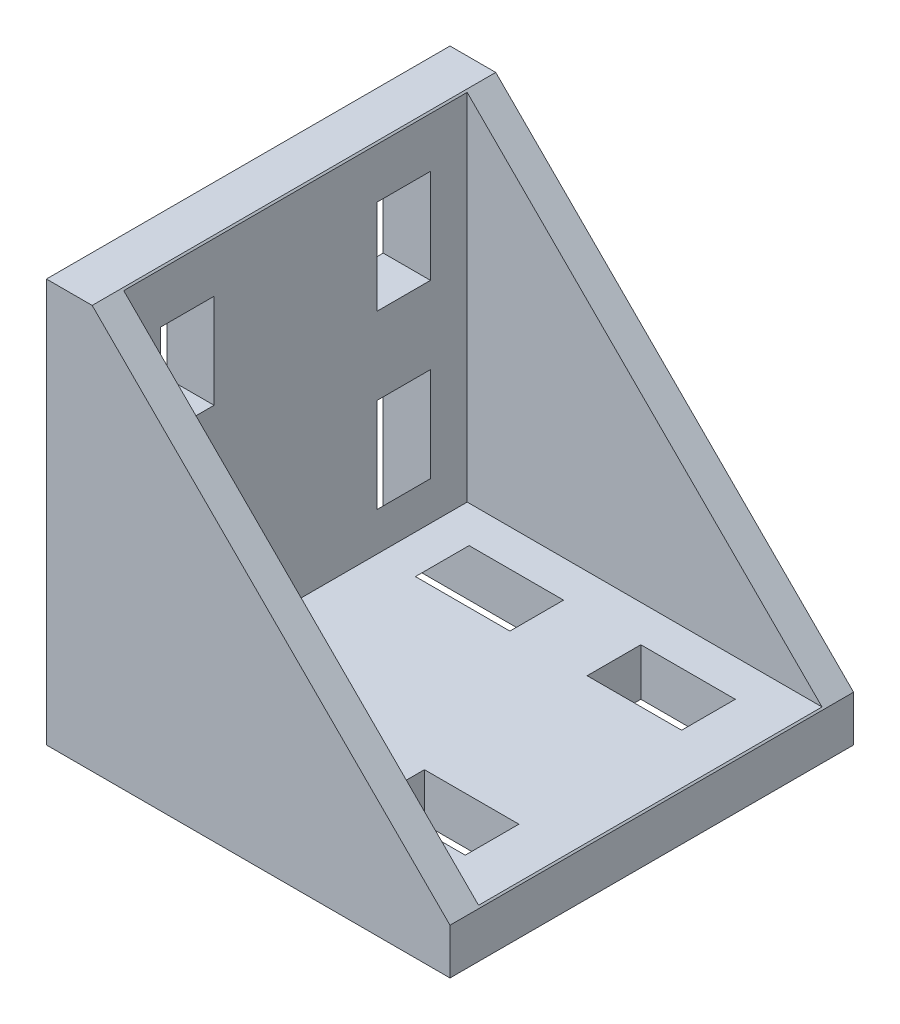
ISO-10303-21;
HEADER;
FILE_DESCRIPTION(('STEP AP214'),'2;1');
FILE_NAME('part.step','',(''),(''),'','','');
FILE_SCHEMA(('AUTOMOTIVE_DESIGN { 1 0 10303 214 1 1 1 1 }'));
ENDSEC;
DATA;
#1=APPLICATION_CONTEXT('core data for automotive mechanical design processes');
#2=APPLICATION_PROTOCOL_DEFINITION('international standard','automotive_design',2000,#1);
#3=PRODUCT_CONTEXT('',#1,'mechanical');
#4=PRODUCT('Part','Part','',(#3));
#5=PRODUCT_RELATED_PRODUCT_CATEGORY('part','',(#4));
#6=PRODUCT_DEFINITION_FORMATION('','',#4);
#7=PRODUCT_DEFINITION_CONTEXT('part definition',#1,'design');
#8=PRODUCT_DEFINITION('design','',#6,#7);
#9=PRODUCT_DEFINITION_SHAPE('','',#8);
#10=(LENGTH_UNIT() NAMED_UNIT(*) SI_UNIT(.MILLI.,.METRE.));
#11=(NAMED_UNIT(*) PLANE_ANGLE_UNIT() SI_UNIT($,.RADIAN.));
#12=(NAMED_UNIT(*) SI_UNIT($,.STERADIAN.) SOLID_ANGLE_UNIT());
#13=UNCERTAINTY_MEASURE_WITH_UNIT(LENGTH_MEASURE(1.E-05),#10,'distance_accuracy_value','');
#14=(GEOMETRIC_REPRESENTATION_CONTEXT(3) GLOBAL_UNCERTAINTY_ASSIGNED_CONTEXT((#13)) GLOBAL_UNIT_ASSIGNED_CONTEXT((#10,
#11,#12)) REPRESENTATION_CONTEXT('',''));
#15=CARTESIAN_POINT('',(0.,0.,0.));
#16=DIRECTION('',(0.,0.,1.));
#17=DIRECTION('',(1.,0.,0.));
#18=AXIS2_PLACEMENT_3D('',#15,#16,#17);
#19=CARTESIAN_POINT('',(0.,0.,23.5));
#20=DIRECTION('',(1.,0.,0.));
#21=DIRECTION('',(0.,0.,-1.));
#22=AXIS2_PLACEMENT_3D('',#19,#20,#21);
#23=PLANE('',#22);
#24=DIRECTION('',(0.,0.,1.));
#25=VECTOR('',#24,1.);
#26=CARTESIAN_POINT('',(0.,43.9992165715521,-15.6));
#27=LINE('',#26,#25);
#28=CARTESIAN_POINT('',(0.,43.9992165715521,-15.6));
#29=VERTEX_POINT('',#28);
#30=CARTESIAN_POINT('',(0.,43.9992165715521,-9.6));
#31=VERTEX_POINT('',#30);
#32=EDGE_CURVE('E544',#29,#31,#27,.T.);
#33=ORIENTED_EDGE('',*,*,#32,.F.);
#34=DIRECTION('',(0.,1.,0.));
#35=VECTOR('',#34,1.);
#36=CARTESIAN_POINT('',(0.,46.3,-15.6));
#37=LINE('',#36,#35);
#38=CARTESIAN_POINT('',(0.,46.3,-15.6));
#39=VERTEX_POINT('',#38);
#40=EDGE_CURVE('E521',#29,#39,#37,.T.);
#41=ORIENTED_EDGE('',*,*,#40,.T.);
#42=DIRECTION('',(0.,0.,1.));
#43=VECTOR('',#42,1.);
#44=CARTESIAN_POINT('',(0.,46.3,-15.6));
#45=LINE('',#44,#43);
#46=CARTESIAN_POINT('',(0.,46.3,-9.6));
#47=VERTEX_POINT('',#46);
#48=EDGE_CURVE('E547',#39,#47,#45,.T.);
#49=ORIENTED_EDGE('',*,*,#48,.T.);
#50=DIRECTION('',(0.,1.,0.));
#51=VECTOR('',#50,1.);
#52=CARTESIAN_POINT('',(0.,46.3,-9.6));
#53=LINE('',#52,#51);
#54=EDGE_CURVE('E533',#31,#47,#53,.T.);
#55=ORIENTED_EDGE('',*,*,#54,.F.);
#56=EDGE_LOOP('',(#33,#41,#49,#55));
#57=FACE_BOUND('',#56,.T.);
#58=DIRECTION('',(0.,-1.,0.));
#59=VECTOR('',#58,1.);
#60=CARTESIAN_POINT('',(0.,41.,-9.475));
#61=LINE('',#60,#59);
#62=CARTESIAN_POINT('',(0.,41.,-9.475));
#63=VERTEX_POINT('',#62);
#64=CARTESIAN_POINT('',(0.,30.,-9.475));
#65=VERTEX_POINT('',#64);
#66=EDGE_CURVE('E645',#63,#65,#61,.T.);
#67=ORIENTED_EDGE('',*,*,#66,.T.);
#68=DIRECTION('',(0.,0.,-1.));
#69=VECTOR('',#68,1.);
#70=CARTESIAN_POINT('',(0.,30.,-9.475));
#71=LINE('',#70,#69);
#72=CARTESIAN_POINT('',(0.,30.,-15.725));
#73=VERTEX_POINT('',#72);
#74=EDGE_CURVE('E666',#65,#73,#71,.T.);
#75=ORIENTED_EDGE('',*,*,#74,.T.);
#76=DIRECTION('',(0.,-1.,0.));
#77=VECTOR('',#76,1.);
#78=CARTESIAN_POINT('',(0.,41.,-15.725));
#79=LINE('',#78,#77);
#80=CARTESIAN_POINT('',(0.,41.,-15.725));
#81=VERTEX_POINT('',#80);
#82=EDGE_CURVE('E637',#81,#73,#79,.T.);
#83=ORIENTED_EDGE('',*,*,#82,.F.);
#84=DIRECTION('',(0.,0.,-1.));
#85=VECTOR('',#84,1.);
#86=CARTESIAN_POINT('',(0.,41.,-9.475));
#87=LINE('',#86,#85);
#88=EDGE_CURVE('E656',#63,#81,#87,.T.);
#89=ORIENTED_EDGE('',*,*,#88,.F.);
#90=EDGE_LOOP('',(#67,#75,#83,#89));
#91=FACE_BOUND('',#90,.T.);
#92=DIRECTION('',(0.,1.,0.));
#93=VECTOR('',#92,1.);
#94=CARTESIAN_POINT('',(0.,1.23475047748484,15.6));
#95=LINE('',#94,#93);
#96=CARTESIAN_POINT('',(0.,1.23475047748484,15.6));
#97=VERTEX_POINT('',#96);
#98=CARTESIAN_POINT('',(0.,3.53553390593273,15.6));
#99=VERTEX_POINT('',#98);
#100=EDGE_CURVE('E800',#97,#99,#95,.T.);
#101=ORIENTED_EDGE('',*,*,#100,.F.);
#102=DIRECTION('',(0.,0.,-1.));
#103=VECTOR('',#102,1.);
#104=CARTESIAN_POINT('',(0.,1.23475047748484,15.6));
#105=LINE('',#104,#103);
#106=CARTESIAN_POINT('',(0.,1.23475047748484,9.6));
#107=VERTEX_POINT('',#106);
#108=EDGE_CURVE('E810',#97,#107,#105,.T.);
#109=ORIENTED_EDGE('',*,*,#108,.T.);
#110=DIRECTION('',(0.,1.,0.));
#111=VECTOR('',#110,1.);
#112=CARTESIAN_POINT('',(0.,1.23475047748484,9.6));
#113=LINE('',#112,#111);
#114=CARTESIAN_POINT('',(0.,3.53553390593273,9.6));
#115=VERTEX_POINT('',#114);
#116=EDGE_CURVE('E799',#107,#115,#113,.T.);
#117=ORIENTED_EDGE('',*,*,#116,.T.);
#118=DIRECTION('',(0.,0.,-1.));
#119=VECTOR('',#118,1.);
#120=CARTESIAN_POINT('',(0.,3.53553390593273,15.6));
#121=LINE('',#120,#119);
#122=EDGE_CURVE('E826',#99,#115,#121,.T.);
#123=ORIENTED_EDGE('',*,*,#122,.F.);
#124=EDGE_LOOP('',(#101,#109,#117,#123));
#125=FACE_BOUND('',#124,.T.);
#126=DIRECTION('',(0.,-1.,0.));
#127=VECTOR('',#126,1.);
#128=CARTESIAN_POINT('',(0.,21.,9.475));
#129=LINE('',#128,#127);
#130=CARTESIAN_POINT('',(0.,21.,9.475));
#131=VERTEX_POINT('',#130);
#132=CARTESIAN_POINT('',(0.,4.5,9.475));
#133=VERTEX_POINT('',#132);
#134=EDGE_CURVE('E964',#131,#133,#129,.T.);
#135=ORIENTED_EDGE('',*,*,#134,.F.);
#136=DIRECTION('',(0.,0.,1.));
#137=VECTOR('',#136,1.);
#138=CARTESIAN_POINT('',(0.,21.,9.475));
#139=LINE('',#138,#137);
#140=CARTESIAN_POINT('',(0.,21.,15.725));
#141=VERTEX_POINT('',#140);
#142=EDGE_CURVE('E987',#131,#141,#139,.T.);
#143=ORIENTED_EDGE('',*,*,#142,.T.);
#144=DIRECTION('',(0.,-1.,0.));
#145=VECTOR('',#144,1.);
#146=CARTESIAN_POINT('',(0.,21.,15.725));
#147=LINE('',#146,#145);
#148=CARTESIAN_POINT('',(0.,4.5,15.725));
#149=VERTEX_POINT('',#148);
#150=EDGE_CURVE('E955',#141,#149,#147,.T.);
#151=ORIENTED_EDGE('',*,*,#150,.T.);
#152=DIRECTION('',(0.,0.,1.));
#153=VECTOR('',#152,1.);
#154=CARTESIAN_POINT('',(0.,4.5,9.475));
#155=LINE('',#154,#153);
#156=EDGE_CURVE('E976',#133,#149,#155,.T.);
#157=ORIENTED_EDGE('',*,*,#156,.F.);
#158=EDGE_LOOP('',(#135,#143,#151,#157));
#159=FACE_BOUND('',#158,.T.);
#160=DIRECTION('',(0.,-1.,0.));
#161=VECTOR('',#160,1.);
#162=CARTESIAN_POINT('',(0.,0.,-23.5));
#163=LINE('',#162,#161);
#164=CARTESIAN_POINT('',(0.,47.,-23.5));
#165=VERTEX_POINT('',#164);
#166=CARTESIAN_POINT('',(0.,0.,-23.5));
#167=VERTEX_POINT('',#166);
#168=EDGE_CURVE('E1029',#165,#167,#163,.T.);
#169=ORIENTED_EDGE('',*,*,#168,.T.);
#170=DIRECTION('',(0.,0.,-1.));
#171=VECTOR('',#170,1.);
#172=CARTESIAN_POINT('',(0.,0.,23.5));
#173=LINE('',#172,#171);
#174=CARTESIAN_POINT('',(0.,0.,23.5));
#175=VERTEX_POINT('',#174);
#176=EDGE_CURVE('E1037',#175,#167,#173,.T.);
#177=ORIENTED_EDGE('',*,*,#176,.F.);
#178=DIRECTION('',(0.,-1.,0.));
#179=VECTOR('',#178,1.);
#180=CARTESIAN_POINT('',(0.,0.,23.5));
#181=LINE('',#180,#179);
#182=CARTESIAN_POINT('',(0.,47.,23.5));
#183=VERTEX_POINT('',#182);
#184=EDGE_CURVE('E1035',#183,#175,#181,.T.);
#185=ORIENTED_EDGE('',*,*,#184,.F.);
#186=DIRECTION('',(0.,0.,-1.));
#187=VECTOR('',#186,1.);
#188=CARTESIAN_POINT('',(0.,47.,23.5));
#189=LINE('',#188,#187);
#190=EDGE_CURVE('E1049',#183,#165,#189,.T.);
#191=ORIENTED_EDGE('',*,*,#190,.T.);
#192=EDGE_LOOP('',(#169,#177,#185,#191));
#193=FACE_BOUND('',#192,.T.);
#194=DIRECTION('',(0.,-1.,0.));
#195=VECTOR('',#194,1.);
#196=CARTESIAN_POINT('',(0.,41.,9.475));
#197=LINE('',#196,#195);
#198=CARTESIAN_POINT('',(0.,41.,9.475));
#199=VERTEX_POINT('',#198);
#200=CARTESIAN_POINT('',(0.,30.,9.475));
#201=VERTEX_POINT('',#200);
#202=EDGE_CURVE('E894',#199,#201,#197,.T.);
#203=ORIENTED_EDGE('',*,*,#202,.F.);
#204=DIRECTION('',(0.,0.,1.));
#205=VECTOR('',#204,1.);
#206=CARTESIAN_POINT('',(0.,41.,9.475));
#207=LINE('',#206,#205);
#208=CARTESIAN_POINT('',(0.,41.,15.725));
#209=VERTEX_POINT('',#208);
#210=EDGE_CURVE('E917',#199,#209,#207,.T.);
#211=ORIENTED_EDGE('',*,*,#210,.T.);
#212=DIRECTION('',(0.,-1.,0.));
#213=VECTOR('',#212,1.);
#214=CARTESIAN_POINT('',(0.,41.,15.725));
#215=LINE('',#214,#213);
#216=CARTESIAN_POINT('',(0.,30.,15.725));
#217=VERTEX_POINT('',#216);
#218=EDGE_CURVE('E885',#209,#217,#215,.T.);
#219=ORIENTED_EDGE('',*,*,#218,.T.);
#220=DIRECTION('',(0.,0.,1.));
#221=VECTOR('',#220,1.);
#222=CARTESIAN_POINT('',(0.,30.,9.475));
#223=LINE('',#222,#221);
#224=EDGE_CURVE('E906',#201,#217,#223,.T.);
#225=ORIENTED_EDGE('',*,*,#224,.F.);
#226=EDGE_LOOP('',(#203,#211,#219,#225));
#227=FACE_BOUND('',#226,.T.);
#228=DIRECTION('',(0.,0.,-1.));
#229=VECTOR('',#228,1.);
#230=CARTESIAN_POINT('',(0.,46.3,15.6));
#231=LINE('',#230,#229);
#232=CARTESIAN_POINT('',(0.,46.3,15.6));
#233=VERTEX_POINT('',#232);
#234=CARTESIAN_POINT('',(0.,46.3,9.6));
#235=VERTEX_POINT('',#234);
#236=EDGE_CURVE('E780',#233,#235,#231,.T.);
#237=ORIENTED_EDGE('',*,*,#236,.F.);
#238=DIRECTION('',(0.,1.,0.));
#239=VECTOR('',#238,1.);
#240=CARTESIAN_POINT('',(0.,46.3,15.6));
#241=LINE('',#240,#239);
#242=CARTESIAN_POINT('',(0.,43.9992165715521,15.6));
#243=VERTEX_POINT('',#242);
#244=EDGE_CURVE('E777',#243,#233,#241,.T.);
#245=ORIENTED_EDGE('',*,*,#244,.F.);
#246=DIRECTION('',(0.,0.,-1.));
#247=VECTOR('',#246,1.);
#248=CARTESIAN_POINT('',(0.,43.9992165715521,15.6));
#249=LINE('',#248,#247);
#250=CARTESIAN_POINT('',(0.,43.9992165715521,9.6));
#251=VERTEX_POINT('',#250);
#252=EDGE_CURVE('E791',#243,#251,#249,.T.);
#253=ORIENTED_EDGE('',*,*,#252,.T.);
#254=DIRECTION('',(0.,1.,0.));
#255=VECTOR('',#254,1.);
#256=CARTESIAN_POINT('',(0.,46.3,9.6));
#257=LINE('',#256,#255);
#258=EDGE_CURVE('E772',#251,#235,#257,.T.);
#259=ORIENTED_EDGE('',*,*,#258,.T.);
#260=EDGE_LOOP('',(#237,#245,#253,#259));
#261=FACE_BOUND('',#260,.T.);
#262=DIRECTION('',(0.,-1.,0.));
#263=VECTOR('',#262,1.);
#264=CARTESIAN_POINT('',(0.,21.,-9.475));
#265=LINE('',#264,#263);
#266=CARTESIAN_POINT('',(0.,21.,-9.475));
#267=VERTEX_POINT('',#266);
#268=CARTESIAN_POINT('',(0.,4.5,-9.475));
#269=VERTEX_POINT('',#268);
#270=EDGE_CURVE('E707',#267,#269,#265,.T.);
#271=ORIENTED_EDGE('',*,*,#270,.T.);
#272=DIRECTION('',(0.,0.,-1.));
#273=VECTOR('',#272,1.);
#274=CARTESIAN_POINT('',(0.,4.5,-9.475));
#275=LINE('',#274,#273);
#276=CARTESIAN_POINT('',(0.,4.5,-15.725));
#277=VERTEX_POINT('',#276);
#278=EDGE_CURVE('E728',#269,#277,#275,.T.);
#279=ORIENTED_EDGE('',*,*,#278,.T.);
#280=DIRECTION('',(0.,-1.,0.));
#281=VECTOR('',#280,1.);
#282=CARTESIAN_POINT('',(0.,21.,-15.725));
#283=LINE('',#282,#281);
#284=CARTESIAN_POINT('',(0.,21.,-15.725));
#285=VERTEX_POINT('',#284);
#286=EDGE_CURVE('E699',#285,#277,#283,.T.);
#287=ORIENTED_EDGE('',*,*,#286,.F.);
#288=DIRECTION('',(0.,0.,-1.));
#289=VECTOR('',#288,1.);
#290=CARTESIAN_POINT('',(0.,21.,-9.475));
#291=LINE('',#290,#289);
#292=EDGE_CURVE('E718',#267,#285,#291,.T.);
#293=ORIENTED_EDGE('',*,*,#292,.F.);
#294=EDGE_LOOP('',(#271,#279,#287,#293));
#295=FACE_BOUND('',#294,.T.);
#296=DIRECTION('',(0.,1.,0.));
#297=VECTOR('',#296,1.);
#298=CARTESIAN_POINT('',(0.,1.23475047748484,-15.6));
#299=LINE('',#298,#297);
#300=CARTESIAN_POINT('',(0.,1.23475047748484,-15.6));
#301=VERTEX_POINT('',#300);
#302=CARTESIAN_POINT('',(0.,3.53553390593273,-15.6));
#303=VERTEX_POINT('',#302);
#304=EDGE_CURVE('E550',#301,#303,#299,.T.);
#305=ORIENTED_EDGE('',*,*,#304,.T.);
#306=DIRECTION('',(0.,0.,1.));
#307=VECTOR('',#306,1.);
#308=CARTESIAN_POINT('',(0.,3.53553390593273,-15.6));
#309=LINE('',#308,#307);
#310=CARTESIAN_POINT('',(0.,3.53553390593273,-9.6));
#311=VERTEX_POINT('',#310);
#312=EDGE_CURVE('E563',#303,#311,#309,.T.);
#313=ORIENTED_EDGE('',*,*,#312,.T.);
#314=DIRECTION('',(0.,1.,0.));
#315=VECTOR('',#314,1.);
#316=CARTESIAN_POINT('',(0.,1.23475047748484,-9.6));
#317=LINE('',#316,#315);
#318=CARTESIAN_POINT('',(0.,1.23475047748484,-9.6));
#319=VERTEX_POINT('',#318);
#320=EDGE_CURVE('E549',#319,#311,#317,.T.);
#321=ORIENTED_EDGE('',*,*,#320,.F.);
#322=DIRECTION('',(0.,0.,1.));
#323=VECTOR('',#322,1.);
#324=CARTESIAN_POINT('',(0.,1.23475047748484,-15.6));
#325=LINE('',#324,#323);
#326=EDGE_CURVE('E578',#301,#319,#325,.T.);
#327=ORIENTED_EDGE('',*,*,#326,.F.);
#328=EDGE_LOOP('',(#305,#313,#321,#327));
#329=FACE_BOUND('',#328,.T.);
#330=ADVANCED_FACE('F32',(#57,#91,#125,#159,#193,#227,#261,#295,#329),#23,.F.);
#331=CARTESIAN_POINT('',(47.,0.,23.5));
#332=DIRECTION('',(0.,1.,0.));
#333=DIRECTION('',(-1.,0.,0.));
#334=AXIS2_PLACEMENT_3D('',#331,#332,#333);
#335=PLANE('',#334);
#336=DIRECTION('',(0.,0.,1.));
#337=VECTOR('',#336,1.);
#338=CARTESIAN_POINT('',(46.3,0.,-15.6));
#339=LINE('',#338,#337);
#340=CARTESIAN_POINT('',(46.3,0.,-15.6));
#341=VERTEX_POINT('',#340);
#342=CARTESIAN_POINT('',(46.3,0.,-9.6));
#343=VERTEX_POINT('',#342);
#344=EDGE_CURVE('E47',#341,#343,#339,.T.);
#345=ORIENTED_EDGE('',*,*,#344,.F.);
#346=DIRECTION('',(-1.,0.,0.));
#347=VECTOR('',#346,1.);
#348=CARTESIAN_POINT('',(46.3,0.,-15.6));
#349=LINE('',#348,#347);
#350=CARTESIAN_POINT('',(43.9992165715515,0.,-15.6));
#351=VERTEX_POINT('',#350);
#352=EDGE_CURVE('E51',#341,#351,#349,.T.);
#353=ORIENTED_EDGE('',*,*,#352,.T.);
#354=DIRECTION('',(0.,0.,1.));
#355=VECTOR('',#354,1.);
#356=CARTESIAN_POINT('',(43.9992165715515,0.,-15.6));
#357=LINE('',#356,#355);
#358=CARTESIAN_POINT('',(43.9992165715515,0.,-9.6));
#359=VERTEX_POINT('',#358);
#360=EDGE_CURVE('E501',#351,#359,#357,.T.);
#361=ORIENTED_EDGE('',*,*,#360,.T.);
#362=DIRECTION('',(-1.,0.,0.));
#363=VECTOR('',#362,1.);
#364=CARTESIAN_POINT('',(46.3,0.,-9.6));
#365=LINE('',#364,#363);
#366=EDGE_CURVE('E505',#343,#359,#365,.T.);
#367=ORIENTED_EDGE('',*,*,#366,.F.);
#368=EDGE_LOOP('',(#345,#353,#361,#367));
#369=FACE_BOUND('',#368,.T.);
#370=DIRECTION('',(1.,0.,0.));
#371=VECTOR('',#370,1.);
#372=CARTESIAN_POINT('',(4.5,0.,-9.475));
#373=LINE('',#372,#371);
#374=CARTESIAN_POINT('',(4.5,0.,-9.475));
#375=VERTEX_POINT('',#374);
#376=CARTESIAN_POINT('',(21.,0.,-9.475));
#377=VERTEX_POINT('',#376);
#378=EDGE_CURVE('E685',#375,#377,#373,.T.);
#379=ORIENTED_EDGE('',*,*,#378,.T.);
#380=DIRECTION('',(0.,0.,-1.));
#381=VECTOR('',#380,1.);
#382=CARTESIAN_POINT('',(21.,0.,-9.475));
#383=LINE('',#382,#381);
#384=CARTESIAN_POINT('',(21.,0.,-15.725));
#385=VERTEX_POINT('',#384);
#386=EDGE_CURVE('E700',#377,#385,#383,.T.);
#387=ORIENTED_EDGE('',*,*,#386,.T.);
#388=DIRECTION('',(1.,0.,0.));
#389=VECTOR('',#388,1.);
#390=CARTESIAN_POINT('',(4.5,0.,-15.725));
#391=LINE('',#390,#389);
#392=CARTESIAN_POINT('',(4.5,0.,-15.725));
#393=VERTEX_POINT('',#392);
#394=EDGE_CURVE('E680',#393,#385,#391,.T.);
#395=ORIENTED_EDGE('',*,*,#394,.F.);
#396=DIRECTION('',(0.,0.,-1.));
#397=VECTOR('',#396,1.);
#398=CARTESIAN_POINT('',(4.5,0.,-9.475));
#399=LINE('',#398,#397);
#400=EDGE_CURVE('E696',#375,#393,#399,.T.);
#401=ORIENTED_EDGE('',*,*,#400,.F.);
#402=EDGE_LOOP('',(#379,#387,#395,#401));
#403=FACE_BOUND('',#402,.T.);
#404=DIRECTION('',(0.,0.,-1.));
#405=VECTOR('',#404,1.);
#406=CARTESIAN_POINT('',(43.9992165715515,0.,15.6));
#407=LINE('',#406,#405);
#408=CARTESIAN_POINT('',(43.9992165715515,0.,15.6));
#409=VERTEX_POINT('',#408);
#410=CARTESIAN_POINT('',(43.9992165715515,0.,9.6));
#411=VERTEX_POINT('',#410);
#412=EDGE_CURVE('E764',#409,#411,#407,.T.);
#413=ORIENTED_EDGE('',*,*,#412,.F.);
#414=DIRECTION('',(-1.,0.,0.));
#415=VECTOR('',#414,1.);
#416=CARTESIAN_POINT('',(46.3,0.,15.6));
#417=LINE('',#416,#415);
#418=CARTESIAN_POINT('',(46.3,0.,15.6));
#419=VERTEX_POINT('',#418);
#420=EDGE_CURVE('E738',#419,#409,#417,.T.);
#421=ORIENTED_EDGE('',*,*,#420,.F.);
#422=DIRECTION('',(0.,0.,-1.));
#423=VECTOR('',#422,1.);
#424=CARTESIAN_POINT('',(46.3,0.,15.6));
#425=LINE('',#424,#423);
#426=CARTESIAN_POINT('',(46.3,0.,9.6));
#427=VERTEX_POINT('',#426);
#428=EDGE_CURVE('E749',#419,#427,#425,.T.);
#429=ORIENTED_EDGE('',*,*,#428,.T.);
#430=DIRECTION('',(-1.,0.,0.));
#431=VECTOR('',#430,1.);
#432=CARTESIAN_POINT('',(46.3,0.,9.6));
#433=LINE('',#432,#431);
#434=EDGE_CURVE('E731',#427,#411,#433,.T.);
#435=ORIENTED_EDGE('',*,*,#434,.T.);
#436=EDGE_LOOP('',(#413,#421,#429,#435));
#437=FACE_BOUND('',#436,.T.);
#438=DIRECTION('',(1.,0.,0.));
#439=VECTOR('',#438,1.);
#440=CARTESIAN_POINT('',(4.5,0.,9.475));
#441=LINE('',#440,#439);
#442=CARTESIAN_POINT('',(4.5,0.,9.475));
#443=VERTEX_POINT('',#442);
#444=CARTESIAN_POINT('',(21.,0.,9.475));
#445=VERTEX_POINT('',#444);
#446=EDGE_CURVE('E932',#443,#445,#441,.T.);
#447=ORIENTED_EDGE('',*,*,#446,.F.);
#448=DIRECTION('',(0.,0.,1.));
#449=VECTOR('',#448,1.);
#450=CARTESIAN_POINT('',(4.5,0.,9.475));
#451=LINE('',#450,#449);
#452=CARTESIAN_POINT('',(4.5,0.,15.725));
#453=VERTEX_POINT('',#452);
#454=EDGE_CURVE('E942',#443,#453,#451,.T.);
#455=ORIENTED_EDGE('',*,*,#454,.T.);
#456=DIRECTION('',(1.,0.,0.));
#457=VECTOR('',#456,1.);
#458=CARTESIAN_POINT('',(4.5,0.,15.725));
#459=LINE('',#458,#457);
#460=CARTESIAN_POINT('',(21.,0.,15.725));
#461=VERTEX_POINT('',#460);
#462=EDGE_CURVE('E945',#453,#461,#459,.T.);
#463=ORIENTED_EDGE('',*,*,#462,.T.);
#464=DIRECTION('',(0.,0.,1.));
#465=VECTOR('',#464,1.);
#466=CARTESIAN_POINT('',(21.,0.,9.475));
#467=LINE('',#466,#465);
#468=EDGE_CURVE('E959',#445,#461,#467,.T.);
#469=ORIENTED_EDGE('',*,*,#468,.F.);
#470=EDGE_LOOP('',(#447,#455,#463,#469));
#471=FACE_BOUND('',#470,.T.);
#472=DIRECTION('',(1.,0.,0.));
#473=VECTOR('',#472,1.);
#474=CARTESIAN_POINT('',(47.,0.,-23.5));
#475=LINE('',#474,#473);
#476=CARTESIAN_POINT('',(47.,0.,-23.5));
#477=VERTEX_POINT('',#476);
#478=EDGE_CURVE('E1020',#167,#477,#475,.T.);
#479=ORIENTED_EDGE('',*,*,#478,.T.);
#480=DIRECTION('',(0.,0.,-1.));
#481=VECTOR('',#480,1.);
#482=CARTESIAN_POINT('',(47.,0.,23.5));
#483=LINE('',#482,#481);
#484=CARTESIAN_POINT('',(47.,0.,23.5));
#485=VERTEX_POINT('',#484);
#486=EDGE_CURVE('E11',#485,#477,#483,.T.);
#487=ORIENTED_EDGE('',*,*,#486,.F.);
#488=DIRECTION('',(1.,0.,0.));
#489=VECTOR('',#488,1.);
#490=CARTESIAN_POINT('',(47.,0.,23.5));
#491=LINE('',#490,#489);
#492=EDGE_CURVE('E1025',#175,#485,#491,.T.);
#493=ORIENTED_EDGE('',*,*,#492,.F.);
#494=ORIENTED_EDGE('',*,*,#176,.T.);
#495=EDGE_LOOP('',(#479,#487,#493,#494));
#496=FACE_BOUND('',#495,.T.);
#497=DIRECTION('',(0.,0.,1.));
#498=VECTOR('',#497,1.);
#499=CARTESIAN_POINT('',(41.,0.,9.475));
#500=LINE('',#499,#498);
#501=CARTESIAN_POINT('',(41.,0.,9.475));
#502=VERTEX_POINT('',#501);
#503=CARTESIAN_POINT('',(41.,0.,15.725));
#504=VERTEX_POINT('',#503);
#505=EDGE_CURVE('E889',#502,#504,#500,.T.);
#506=ORIENTED_EDGE('',*,*,#505,.F.);
#507=DIRECTION('',(1.,0.,0.));
#508=VECTOR('',#507,1.);
#509=CARTESIAN_POINT('',(30.,0.,9.475));
#510=LINE('',#509,#508);
#511=CARTESIAN_POINT('',(30.,0.,9.475));
#512=VERTEX_POINT('',#511);
#513=EDGE_CURVE('E862',#512,#502,#510,.T.);
#514=ORIENTED_EDGE('',*,*,#513,.F.);
#515=DIRECTION('',(0.,0.,1.));
#516=VECTOR('',#515,1.);
#517=CARTESIAN_POINT('',(30.,0.,9.475));
#518=LINE('',#517,#516);
#519=CARTESIAN_POINT('',(30.,0.,15.725));
#520=VERTEX_POINT('',#519);
#521=EDGE_CURVE('E872',#512,#520,#518,.T.);
#522=ORIENTED_EDGE('',*,*,#521,.T.);
#523=DIRECTION('',(1.,0.,0.));
#524=VECTOR('',#523,1.);
#525=CARTESIAN_POINT('',(30.,0.,15.725));
#526=LINE('',#525,#524);
#527=EDGE_CURVE('E875',#520,#504,#526,.T.);
#528=ORIENTED_EDGE('',*,*,#527,.T.);
#529=EDGE_LOOP('',(#506,#514,#522,#528));
#530=FACE_BOUND('',#529,.T.);
#531=DIRECTION('',(-1.,0.,0.));
#532=VECTOR('',#531,1.);
#533=CARTESIAN_POINT('',(1.23475047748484,0.,15.6));
#534=LINE('',#533,#532);
#535=CARTESIAN_POINT('',(3.53553390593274,0.,15.6));
#536=VERTEX_POINT('',#535);
#537=CARTESIAN_POINT('',(1.23475047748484,0.,15.6));
#538=VERTEX_POINT('',#537);
#539=EDGE_CURVE('E831',#536,#538,#534,.T.);
#540=ORIENTED_EDGE('',*,*,#539,.F.);
#541=DIRECTION('',(0.,0.,-1.));
#542=VECTOR('',#541,1.);
#543=CARTESIAN_POINT('',(3.53553390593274,0.,15.6));
#544=LINE('',#543,#542);
#545=CARTESIAN_POINT('',(3.53553390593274,0.,9.6));
#546=VERTEX_POINT('',#545);
#547=EDGE_CURVE('E855',#536,#546,#544,.T.);
#548=ORIENTED_EDGE('',*,*,#547,.T.);
#549=DIRECTION('',(-1.,0.,0.));
#550=VECTOR('',#549,1.);
#551=CARTESIAN_POINT('',(1.23475047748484,0.,9.6));
#552=LINE('',#551,#550);
#553=CARTESIAN_POINT('',(1.23475047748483,0.,9.6));
#554=VERTEX_POINT('',#553);
#555=EDGE_CURVE('E841',#546,#554,#552,.T.);
#556=ORIENTED_EDGE('',*,*,#555,.T.);
#557=DIRECTION('',(0.,0.,-1.));
#558=VECTOR('',#557,1.);
#559=CARTESIAN_POINT('',(1.23475047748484,0.,15.6));
#560=LINE('',#559,#558);
#561=EDGE_CURVE('E852',#538,#554,#560,.T.);
#562=ORIENTED_EDGE('',*,*,#561,.F.);
#563=EDGE_LOOP('',(#540,#548,#556,#562));
#564=FACE_BOUND('',#563,.T.);
#565=DIRECTION('',(0.,0.,-1.));
#566=VECTOR('',#565,1.);
#567=CARTESIAN_POINT('',(30.,0.,-9.475));
#568=LINE('',#567,#566);
#569=CARTESIAN_POINT('',(30.,0.,-9.475));
#570=VERTEX_POINT('',#569);
#571=CARTESIAN_POINT('',(30.,0.,-15.725));
#572=VERTEX_POINT('',#571);
#573=EDGE_CURVE('E634',#570,#572,#568,.T.);
#574=ORIENTED_EDGE('',*,*,#573,.F.);
#575=DIRECTION('',(1.,0.,0.));
#576=VECTOR('',#575,1.);
#577=CARTESIAN_POINT('',(30.,0.,-9.475));
#578=LINE('',#577,#576);
#579=CARTESIAN_POINT('',(41.,0.,-9.475));
#580=VERTEX_POINT('',#579);
#581=EDGE_CURVE('E623',#570,#580,#578,.T.);
#582=ORIENTED_EDGE('',*,*,#581,.T.);
#583=DIRECTION('',(0.,0.,-1.));
#584=VECTOR('',#583,1.);
#585=CARTESIAN_POINT('',(41.,0.,-9.475));
#586=LINE('',#585,#584);
#587=CARTESIAN_POINT('',(41.,0.,-15.725));
#588=VERTEX_POINT('',#587);
#589=EDGE_CURVE('E638',#580,#588,#586,.T.);
#590=ORIENTED_EDGE('',*,*,#589,.T.);
#591=DIRECTION('',(1.,0.,0.));
#592=VECTOR('',#591,1.);
#593=CARTESIAN_POINT('',(30.,0.,-15.725));
#594=LINE('',#593,#592);
#595=EDGE_CURVE('E618',#572,#588,#594,.T.);
#596=ORIENTED_EDGE('',*,*,#595,.F.);
#597=EDGE_LOOP('',(#574,#582,#590,#596));
#598=FACE_BOUND('',#597,.T.);
#599=DIRECTION('',(-1.,0.,0.));
#600=VECTOR('',#599,1.);
#601=CARTESIAN_POINT('',(1.23475047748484,0.,-15.6));
#602=LINE('',#601,#600);
#603=CARTESIAN_POINT('',(3.53553390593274,0.,-15.6));
#604=VERTEX_POINT('',#603);
#605=CARTESIAN_POINT('',(1.23475047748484,0.,-15.6));
#606=VERTEX_POINT('',#605);
#607=EDGE_CURVE('E591',#604,#606,#602,.T.);
#608=ORIENTED_EDGE('',*,*,#607,.T.);
#609=DIRECTION('',(0.,0.,1.));
#610=VECTOR('',#609,1.);
#611=CARTESIAN_POINT('',(1.23475047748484,0.,-15.6));
#612=LINE('',#611,#610);
#613=CARTESIAN_POINT('',(1.23475047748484,0.,-9.6));
#614=VERTEX_POINT('',#613);
#615=EDGE_CURVE('E606',#606,#614,#612,.T.);
#616=ORIENTED_EDGE('',*,*,#615,.T.);
#617=DIRECTION('',(-1.,0.,0.));
#618=VECTOR('',#617,1.);
#619=CARTESIAN_POINT('',(1.23475047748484,0.,-9.6));
#620=LINE('',#619,#618);
#621=CARTESIAN_POINT('',(3.53553390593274,0.,-9.6));
#622=VERTEX_POINT('',#621);
#623=EDGE_CURVE('E585',#622,#614,#620,.T.);
#624=ORIENTED_EDGE('',*,*,#623,.F.);
#625=DIRECTION('',(0.,0.,1.));
#626=VECTOR('',#625,1.);
#627=CARTESIAN_POINT('',(3.53553390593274,0.,-15.6));
#628=LINE('',#627,#626);
#629=EDGE_CURVE('E594',#604,#622,#628,.T.);
#630=ORIENTED_EDGE('',*,*,#629,.F.);
#631=EDGE_LOOP('',(#608,#616,#624,#630));
#632=FACE_BOUND('',#631,.T.);
#633=ADVANCED_FACE('F34',(#369,#403,#437,#471,#496,#530,#564,#598,#632),#335,.F.);
#634=CARTESIAN_POINT('',(5.5,46.8259018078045,-20.));
#635=DIRECTION('',(-1.,0.,0.));
#636=DIRECTION('',(0.,-1.,0.));
#637=AXIS2_PLACEMENT_3D('',#634,#635,#636);
#638=PLANE('',#637);
#639=DIRECTION('',(0.,1.,0.));
#640=VECTOR('',#639,1.);
#641=CARTESIAN_POINT('',(5.5,21.,-9.475));
#642=LINE('',#641,#640);
#643=CARTESIAN_POINT('',(5.5,10.,-9.475));
#644=VERTEX_POINT('',#643);
#645=CARTESIAN_POINT('',(5.5,21.,-9.475));
#646=VERTEX_POINT('',#645);
#647=EDGE_CURVE('E713',#644,#646,#642,.T.);
#648=ORIENTED_EDGE('',*,*,#647,.T.);
#649=DIRECTION('',(0.,0.,-1.));
#650=VECTOR('',#649,1.);
#651=CARTESIAN_POINT('',(5.5,21.,-9.475));
#652=LINE('',#651,#650);
#653=CARTESIAN_POINT('',(5.5,21.,-15.725));
#654=VERTEX_POINT('',#653);
#655=EDGE_CURVE('E734',#646,#654,#652,.T.);
#656=ORIENTED_EDGE('',*,*,#655,.T.);
#657=DIRECTION('',(0.,1.,0.));
#658=VECTOR('',#657,1.);
#659=CARTESIAN_POINT('',(5.5,21.,-15.725));
#660=LINE('',#659,#658);
#661=CARTESIAN_POINT('',(5.5,10.,-15.725));
#662=VERTEX_POINT('',#661);
#663=EDGE_CURVE('E724',#662,#654,#660,.T.);
#664=ORIENTED_EDGE('',*,*,#663,.F.);
#665=DIRECTION('',(0.,0.,-1.));
#666=VECTOR('',#665,1.);
#667=CARTESIAN_POINT('',(5.5,10.,-9.475));
#668=LINE('',#667,#666);
#669=EDGE_CURVE('E732',#644,#662,#668,.T.);
#670=ORIENTED_EDGE('',*,*,#669,.F.);
#671=EDGE_LOOP('',(#648,#656,#664,#670));
#672=FACE_BOUND('',#671,.T.);
#673=DIRECTION('',(0.,1.,0.));
#674=VECTOR('',#673,1.);
#675=CARTESIAN_POINT('',(5.5,21.,9.475));
#676=LINE('',#675,#674);
#677=CARTESIAN_POINT('',(5.5,10.,9.475));
#678=VERTEX_POINT('',#677);
#679=CARTESIAN_POINT('',(5.5,21.,9.475));
#680=VERTEX_POINT('',#679);
#681=EDGE_CURVE('E971',#678,#680,#676,.T.);
#682=ORIENTED_EDGE('',*,*,#681,.F.);
#683=DIRECTION('',(0.,0.,1.));
#684=VECTOR('',#683,1.);
#685=CARTESIAN_POINT('',(5.5,10.,9.475));
#686=LINE('',#685,#684);
#687=CARTESIAN_POINT('',(5.5,10.,15.725));
#688=VERTEX_POINT('',#687);
#689=EDGE_CURVE('E994',#678,#688,#686,.T.);
#690=ORIENTED_EDGE('',*,*,#689,.T.);
#691=DIRECTION('',(0.,1.,0.));
#692=VECTOR('',#691,1.);
#693=CARTESIAN_POINT('',(5.5,21.,15.725));
#694=LINE('',#693,#692);
#695=CARTESIAN_POINT('',(5.5,21.,15.725));
#696=VERTEX_POINT('',#695);
#697=EDGE_CURVE('E982',#688,#696,#694,.T.);
#698=ORIENTED_EDGE('',*,*,#697,.T.);
#699=DIRECTION('',(0.,0.,1.));
#700=VECTOR('',#699,1.);
#701=CARTESIAN_POINT('',(5.5,21.,9.475));
#702=LINE('',#701,#700);
#703=EDGE_CURVE('E991',#680,#696,#702,.T.);
#704=ORIENTED_EDGE('',*,*,#703,.F.);
#705=EDGE_LOOP('',(#682,#690,#698,#704));
#706=FACE_BOUND('',#705,.T.);
#707=DIRECTION('',(0.,-1.,0.));
#708=VECTOR('',#707,1.);
#709=CARTESIAN_POINT('',(5.5,46.8259018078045,20.));
#710=LINE('',#709,#708);
#711=CARTESIAN_POINT('',(5.50000000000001,46.8259018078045,20.));
#712=VERTEX_POINT('',#711);
#713=CARTESIAN_POINT('',(5.50000000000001,5.5,20.));
#714=VERTEX_POINT('',#713);
#715=EDGE_CURVE('E1012',#712,#714,#710,.T.);
#716=ORIENTED_EDGE('',*,*,#715,.T.);
#717=DIRECTION('',(0.,0.,1.));
#718=VECTOR('',#717,1.);
#719=CARTESIAN_POINT('',(5.50000000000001,5.5,-20.));
#720=LINE('',#719,#718);
#721=CARTESIAN_POINT('',(5.50000000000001,5.5,-20.));
#722=VERTEX_POINT('',#721);
#723=EDGE_CURVE('E1021',#722,#714,#720,.T.);
#724=ORIENTED_EDGE('',*,*,#723,.F.);
#725=DIRECTION('',(0.,-1.,0.));
#726=VECTOR('',#725,1.);
#727=CARTESIAN_POINT('',(5.5,46.8259018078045,-20.));
#728=LINE('',#727,#726);
#729=CARTESIAN_POINT('',(5.5,46.8259018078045,-20.));
#730=VERTEX_POINT('',#729);
#731=EDGE_CURVE('E1002',#730,#722,#728,.T.);
#732=ORIENTED_EDGE('',*,*,#731,.F.);
#733=DIRECTION('',(0.,0.,1.));
#734=VECTOR('',#733,1.);
#735=CARTESIAN_POINT('',(5.5,46.8259018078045,-20.));
#736=LINE('',#735,#734);
#737=EDGE_CURVE('E1009',#730,#712,#736,.T.);
#738=ORIENTED_EDGE('',*,*,#737,.T.);
#739=EDGE_LOOP('',(#716,#724,#732,#738));
#740=FACE_BOUND('',#739,.T.);
#741=DIRECTION('',(0.,1.,0.));
#742=VECTOR('',#741,1.);
#743=CARTESIAN_POINT('',(5.5,41.,9.475));
#744=LINE('',#743,#742);
#745=CARTESIAN_POINT('',(5.5,30.,9.475));
#746=VERTEX_POINT('',#745);
#747=CARTESIAN_POINT('',(5.5,41.,9.475));
#748=VERTEX_POINT('',#747);
#749=EDGE_CURVE('E901',#746,#748,#744,.T.);
#750=ORIENTED_EDGE('',*,*,#749,.F.);
#751=DIRECTION('',(0.,0.,1.));
#752=VECTOR('',#751,1.);
#753=CARTESIAN_POINT('',(5.5,30.,9.475));
#754=LINE('',#753,#752);
#755=CARTESIAN_POINT('',(5.5,30.,15.725));
#756=VERTEX_POINT('',#755);
#757=EDGE_CURVE('E924',#746,#756,#754,.T.);
#758=ORIENTED_EDGE('',*,*,#757,.T.);
#759=DIRECTION('',(0.,1.,0.));
#760=VECTOR('',#759,1.);
#761=CARTESIAN_POINT('',(5.5,41.,15.725));
#762=LINE('',#761,#760);
#763=CARTESIAN_POINT('',(5.5,41.,15.725));
#764=VERTEX_POINT('',#763);
#765=EDGE_CURVE('E912',#756,#764,#762,.T.);
#766=ORIENTED_EDGE('',*,*,#765,.T.);
#767=DIRECTION('',(0.,0.,1.));
#768=VECTOR('',#767,1.);
#769=CARTESIAN_POINT('',(5.5,41.,9.475));
#770=LINE('',#769,#768);
#771=EDGE_CURVE('E921',#748,#764,#770,.T.);
#772=ORIENTED_EDGE('',*,*,#771,.F.);
#773=EDGE_LOOP('',(#750,#758,#766,#772));
#774=FACE_BOUND('',#773,.T.);
#775=DIRECTION('',(0.,1.,0.));
#776=VECTOR('',#775,1.);
#777=CARTESIAN_POINT('',(5.5,41.,-9.475));
#778=LINE('',#777,#776);
#779=CARTESIAN_POINT('',(5.5,30.,-9.475));
#780=VERTEX_POINT('',#779);
#781=CARTESIAN_POINT('',(5.5,41.,-9.475));
#782=VERTEX_POINT('',#781);
#783=EDGE_CURVE('E651',#780,#782,#778,.T.);
#784=ORIENTED_EDGE('',*,*,#783,.T.);
#785=DIRECTION('',(0.,0.,-1.));
#786=VECTOR('',#785,1.);
#787=CARTESIAN_POINT('',(5.5,41.,-9.475));
#788=LINE('',#787,#786);
#789=CARTESIAN_POINT('',(5.5,41.,-15.725));
#790=VERTEX_POINT('',#789);
#791=EDGE_CURVE('E672',#782,#790,#788,.T.);
#792=ORIENTED_EDGE('',*,*,#791,.T.);
#793=DIRECTION('',(0.,1.,0.));
#794=VECTOR('',#793,1.);
#795=CARTESIAN_POINT('',(5.5,41.,-15.725));
#796=LINE('',#795,#794);
#797=CARTESIAN_POINT('',(5.5,30.,-15.725));
#798=VERTEX_POINT('',#797);
#799=EDGE_CURVE('E662',#798,#790,#796,.T.);
#800=ORIENTED_EDGE('',*,*,#799,.F.);
#801=DIRECTION('',(0.,0.,-1.));
#802=VECTOR('',#801,1.);
#803=CARTESIAN_POINT('',(5.5,30.,-9.475));
#804=LINE('',#803,#802);
#805=EDGE_CURVE('E670',#780,#798,#804,.T.);
#806=ORIENTED_EDGE('',*,*,#805,.F.);
#807=EDGE_LOOP('',(#784,#792,#800,#806));
#808=FACE_BOUND('',#807,.T.);
#809=ADVANCED_FACE('F1084',(#672,#706,#740,#774,#808),#638,.F.);
#810=CARTESIAN_POINT('',(5.50000000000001,5.5,-20.));
#811=DIRECTION('',(0.,-1.,0.));
#812=DIRECTION('',(1.,0.,0.));
#813=AXIS2_PLACEMENT_3D('',#810,#811,#812);
#814=PLANE('',#813);
#815=DIRECTION('',(0.,0.,-1.));
#816=VECTOR('',#815,1.);
#817=CARTESIAN_POINT('',(41.,5.5,-9.475));
#818=LINE('',#817,#816);
#819=CARTESIAN_POINT('',(41.,5.5,-9.475));
#820=VERTEX_POINT('',#819);
#821=CARTESIAN_POINT('',(41.,5.50000000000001,-15.725));
#822=VERTEX_POINT('',#821);
#823=EDGE_CURVE('E641',#820,#822,#818,.T.);
#824=ORIENTED_EDGE('',*,*,#823,.F.);
#825=DIRECTION('',(-1.,0.,0.));
#826=VECTOR('',#825,1.);
#827=CARTESIAN_POINT('',(30.,5.5,-9.475));
#828=LINE('',#827,#826);
#829=CARTESIAN_POINT('',(30.,5.5,-9.475));
#830=VERTEX_POINT('',#829);
#831=EDGE_CURVE('E617',#820,#830,#828,.T.);
#832=ORIENTED_EDGE('',*,*,#831,.T.);
#833=DIRECTION('',(0.,0.,-1.));
#834=VECTOR('',#833,1.);
#835=CARTESIAN_POINT('',(30.,5.5,-9.475));
#836=LINE('',#835,#834);
#837=CARTESIAN_POINT('',(30.,5.5,-15.725));
#838=VERTEX_POINT('',#837);
#839=EDGE_CURVE('E626',#830,#838,#836,.T.);
#840=ORIENTED_EDGE('',*,*,#839,.T.);
#841=DIRECTION('',(-1.,0.,0.));
#842=VECTOR('',#841,1.);
#843=CARTESIAN_POINT('',(30.,5.5,-15.725));
#844=LINE('',#843,#842);
#845=EDGE_CURVE('E628',#822,#838,#844,.T.);
#846=ORIENTED_EDGE('',*,*,#845,.F.);
#847=EDGE_LOOP('',(#824,#832,#840,#846));
#848=FACE_BOUND('',#847,.T.);
#849=DIRECTION('',(-1.,0.,0.));
#850=VECTOR('',#849,1.);
#851=CARTESIAN_POINT('',(10.,5.5,9.475));
#852=LINE('',#851,#850);
#853=CARTESIAN_POINT('',(21.,5.5,9.475));
#854=VERTEX_POINT('',#853);
#855=CARTESIAN_POINT('',(10.,5.5,9.475));
#856=VERTEX_POINT('',#855);
#857=EDGE_CURVE('E939',#854,#856,#852,.T.);
#858=ORIENTED_EDGE('',*,*,#857,.F.);
#859=DIRECTION('',(0.,0.,1.));
#860=VECTOR('',#859,1.);
#861=CARTESIAN_POINT('',(21.,5.5,9.475));
#862=LINE('',#861,#860);
#863=CARTESIAN_POINT('',(21.,5.5,15.725));
#864=VERTEX_POINT('',#863);
#865=EDGE_CURVE('E956',#854,#864,#862,.T.);
#866=ORIENTED_EDGE('',*,*,#865,.T.);
#867=DIRECTION('',(-1.,0.,0.));
#868=VECTOR('',#867,1.);
#869=CARTESIAN_POINT('',(10.,5.5,15.725));
#870=LINE('',#869,#868);
#871=CARTESIAN_POINT('',(10.,5.5,15.725));
#872=VERTEX_POINT('',#871);
#873=EDGE_CURVE('E933',#864,#872,#870,.T.);
#874=ORIENTED_EDGE('',*,*,#873,.T.);
#875=DIRECTION('',(0.,0.,1.));
#876=VECTOR('',#875,1.);
#877=CARTESIAN_POINT('',(10.,5.5,9.475));
#878=LINE('',#877,#876);
#879=EDGE_CURVE('E952',#856,#872,#878,.T.);
#880=ORIENTED_EDGE('',*,*,#879,.F.);
#881=EDGE_LOOP('',(#858,#866,#874,#880));
#882=FACE_BOUND('',#881,.T.);
#883=DIRECTION('',(1.,0.,0.));
#884=VECTOR('',#883,1.);
#885=CARTESIAN_POINT('',(5.50000000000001,5.5,20.));
#886=LINE('',#885,#884);
#887=CARTESIAN_POINT('',(46.8259018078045,5.50000000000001,20.));
#888=VERTEX_POINT('',#887);
#889=EDGE_CURVE('E1003',#714,#888,#886,.T.);
#890=ORIENTED_EDGE('',*,*,#889,.T.);
#891=DIRECTION('',(0.,0.,1.));
#892=VECTOR('',#891,1.);
#893=CARTESIAN_POINT('',(46.8259018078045,5.50000000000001,-20.));
#894=LINE('',#893,#892);
#895=CARTESIAN_POINT('',(46.8259018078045,5.50000000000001,-20.));
#896=VERTEX_POINT('',#895);
#897=EDGE_CURVE('E1017',#896,#888,#894,.T.);
#898=ORIENTED_EDGE('',*,*,#897,.F.);
#899=DIRECTION('',(1.,0.,0.));
#900=VECTOR('',#899,1.);
#901=CARTESIAN_POINT('',(5.50000000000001,5.5,-20.));
#902=LINE('',#901,#900);
#903=EDGE_CURVE('E1006',#722,#896,#902,.T.);
#904=ORIENTED_EDGE('',*,*,#903,.F.);
#905=ORIENTED_EDGE('',*,*,#723,.T.);
#906=EDGE_LOOP('',(#890,#898,#904,#905));
#907=FACE_BOUND('',#906,.T.);
#908=DIRECTION('',(0.,0.,1.));
#909=VECTOR('',#908,1.);
#910=CARTESIAN_POINT('',(30.,5.5,9.475));
#911=LINE('',#910,#909);
#912=CARTESIAN_POINT('',(30.,5.5,9.475));
#913=VERTEX_POINT('',#912);
#914=CARTESIAN_POINT('',(30.,5.5,15.725));
#915=VERTEX_POINT('',#914);
#916=EDGE_CURVE('E882',#913,#915,#911,.T.);
#917=ORIENTED_EDGE('',*,*,#916,.F.);
#918=DIRECTION('',(-1.,0.,0.));
#919=VECTOR('',#918,1.);
#920=CARTESIAN_POINT('',(30.,5.5,9.475));
#921=LINE('',#920,#919);
#922=CARTESIAN_POINT('',(41.,5.5,9.475));
#923=VERTEX_POINT('',#922);
#924=EDGE_CURVE('E869',#923,#913,#921,.T.);
#925=ORIENTED_EDGE('',*,*,#924,.F.);
#926=DIRECTION('',(0.,0.,1.));
#927=VECTOR('',#926,1.);
#928=CARTESIAN_POINT('',(41.,5.5,9.475));
#929=LINE('',#928,#927);
#930=CARTESIAN_POINT('',(41.,5.5,15.725));
#931=VERTEX_POINT('',#930);
#932=EDGE_CURVE('E886',#923,#931,#929,.T.);
#933=ORIENTED_EDGE('',*,*,#932,.T.);
#934=DIRECTION('',(-1.,0.,0.));
#935=VECTOR('',#934,1.);
#936=CARTESIAN_POINT('',(30.,5.5,15.725));
#937=LINE('',#936,#935);
#938=EDGE_CURVE('E863',#931,#915,#937,.T.);
#939=ORIENTED_EDGE('',*,*,#938,.T.);
#940=EDGE_LOOP('',(#917,#925,#933,#939));
#941=FACE_BOUND('',#940,.T.);
#942=DIRECTION('',(-1.,0.,0.));
#943=VECTOR('',#942,1.);
#944=CARTESIAN_POINT('',(10.,5.5,-9.475));
#945=LINE('',#944,#943);
#946=CARTESIAN_POINT('',(21.,5.5,-9.475));
#947=VERTEX_POINT('',#946);
#948=CARTESIAN_POINT('',(10.,5.5,-9.475));
#949=VERTEX_POINT('',#948);
#950=EDGE_CURVE('E679',#947,#949,#945,.T.);
#951=ORIENTED_EDGE('',*,*,#950,.T.);
#952=DIRECTION('',(0.,0.,-1.));
#953=VECTOR('',#952,1.);
#954=CARTESIAN_POINT('',(10.,5.5,-9.475));
#955=LINE('',#954,#953);
#956=CARTESIAN_POINT('',(10.,5.5,-15.725));
#957=VERTEX_POINT('',#956);
#958=EDGE_CURVE('E688',#949,#957,#955,.T.);
#959=ORIENTED_EDGE('',*,*,#958,.T.);
#960=DIRECTION('',(-1.,0.,0.));
#961=VECTOR('',#960,1.);
#962=CARTESIAN_POINT('',(10.,5.5,-15.725));
#963=LINE('',#962,#961);
#964=CARTESIAN_POINT('',(21.,5.5,-15.725));
#965=VERTEX_POINT('',#964);
#966=EDGE_CURVE('E690',#965,#957,#963,.T.);
#967=ORIENTED_EDGE('',*,*,#966,.F.);
#968=DIRECTION('',(0.,0.,-1.));
#969=VECTOR('',#968,1.);
#970=CARTESIAN_POINT('',(21.,5.5,-9.475));
#971=LINE('',#970,#969);
#972=EDGE_CURVE('E703',#947,#965,#971,.T.);
#973=ORIENTED_EDGE('',*,*,#972,.F.);
#974=EDGE_LOOP('',(#951,#959,#967,#973));
#975=FACE_BOUND('',#974,.T.);
#976=ADVANCED_FACE('F1133',(#848,#882,#907,#941,#975),#814,.F.);
#977=CARTESIAN_POINT('',(47.,5.32590180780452,23.5));
#978=DIRECTION('',(-0.707106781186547,-0.707106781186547,0.));
#979=DIRECTION('',(0.707106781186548,-0.707106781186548,0.));
#980=AXIS2_PLACEMENT_3D('',#977,#978,#979);
#981=PLANE('',#980);
#982=DIRECTION('',(-0.707106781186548,0.707106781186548,0.));
#983=VECTOR('',#982,1.);
#984=CARTESIAN_POINT('',(47.,5.32590180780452,-23.5));
#985=LINE('',#984,#983);
#986=CARTESIAN_POINT('',(47.,5.32590180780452,-23.5));
#987=VERTEX_POINT('',#986);
#988=CARTESIAN_POINT('',(5.32590180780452,47.,-23.5));
#989=VERTEX_POINT('',#988);
#990=EDGE_CURVE('E1042',#987,#989,#985,.T.);
#991=ORIENTED_EDGE('',*,*,#990,.T.);
#992=DIRECTION('',(0.,0.,-1.));
#993=VECTOR('',#992,1.);
#994=CARTESIAN_POINT('',(5.32590180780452,47.,23.5));
#995=LINE('',#994,#993);
#996=CARTESIAN_POINT('',(5.32590180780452,47.,23.5));
#997=VERTEX_POINT('',#996);
#998=EDGE_CURVE('E1052',#997,#989,#995,.T.);
#999=ORIENTED_EDGE('',*,*,#998,.F.);
#1000=DIRECTION('',(-0.707106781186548,0.707106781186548,0.));
#1001=VECTOR('',#1000,1.);
#1002=CARTESIAN_POINT('',(47.,5.32590180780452,23.5));
#1003=LINE('',#1002,#1001);
#1004=CARTESIAN_POINT('',(47.,5.32590180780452,23.5));
#1005=VERTEX_POINT('',#1004);
#1006=EDGE_CURVE('E1031',#1005,#997,#1003,.T.);
#1007=ORIENTED_EDGE('',*,*,#1006,.F.);
#1008=DIRECTION('',(0.,0.,-1.));
#1009=VECTOR('',#1008,1.);
#1010=CARTESIAN_POINT('',(47.,5.32590180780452,23.5));
#1011=LINE('',#1010,#1009);
#1012=EDGE_CURVE('E40',#1005,#987,#1011,.T.);
#1013=ORIENTED_EDGE('',*,*,#1012,.T.);
#1014=EDGE_LOOP('',(#991,#999,#1007,#1013));
#1015=FACE_BOUND('',#1014,.T.);
#1016=DIRECTION('',(-0.707106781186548,0.707106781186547,0.));
#1017=VECTOR('',#1016,1.);
#1018=CARTESIAN_POINT('',(5.5,46.8259018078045,-20.));
#1019=LINE('',#1018,#1017);
#1020=EDGE_CURVE('E999',#896,#730,#1019,.T.);
#1021=ORIENTED_EDGE('',*,*,#1020,.F.);
#1022=ORIENTED_EDGE('',*,*,#897,.T.);
#1023=DIRECTION('',(-0.707106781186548,0.707106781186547,0.));
#1024=VECTOR('',#1023,1.);
#1025=CARTESIAN_POINT('',(5.5,46.8259018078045,20.));
#1026=LINE('',#1025,#1024);
#1027=EDGE_CURVE('E990',#888,#712,#1026,.T.);
#1028=ORIENTED_EDGE('',*,*,#1027,.T.);
#1029=ORIENTED_EDGE('',*,*,#737,.F.);
#1030=EDGE_LOOP('',(#1021,#1022,#1028,#1029));
#1031=FACE_BOUND('',#1030,.T.);
#1032=ADVANCED_FACE('F1059',(#1015,#1031),#981,.F.);
#1033=CARTESIAN_POINT('',(47.,5.32590180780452,23.5));
#1034=DIRECTION('',(-1.,0.,0.));
#1035=DIRECTION('',(0.,0.,1.));
#1036=AXIS2_PLACEMENT_3D('',#1033,#1034,#1035);
#1037=PLANE('',#1036);
#1038=DIRECTION('',(0.,1.,0.));
#1039=VECTOR('',#1038,1.);
#1040=CARTESIAN_POINT('',(47.,5.32590180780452,-23.5));
#1041=LINE('',#1040,#1039);
#1042=EDGE_CURVE('E1040',#477,#987,#1041,.T.);
#1043=ORIENTED_EDGE('',*,*,#1042,.T.);
#1044=ORIENTED_EDGE('',*,*,#1012,.F.);
#1045=DIRECTION('',(0.,1.,0.));
#1046=VECTOR('',#1045,1.);
#1047=CARTESIAN_POINT('',(47.,5.32590180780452,23.5));
#1048=LINE('',#1047,#1046);
#1049=EDGE_CURVE('E1028',#485,#1005,#1048,.T.);
#1050=ORIENTED_EDGE('',*,*,#1049,.F.);
#1051=ORIENTED_EDGE('',*,*,#486,.T.);
#1052=EDGE_LOOP('',(#1043,#1044,#1050,#1051));
#1053=FACE_BOUND('',#1052,.T.);
#1054=ADVANCED_FACE('F1080',(#1053),#1037,.F.);
#1055=CARTESIAN_POINT('',(5.32590180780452,47.,23.5));
#1056=DIRECTION('',(0.,-1.,0.));
#1057=DIRECTION('',(0.,0.,-1.));
#1058=AXIS2_PLACEMENT_3D('',#1055,#1056,#1057);
#1059=PLANE('',#1058);
#1060=DIRECTION('',(-1.,0.,0.));
#1061=VECTOR('',#1060,1.);
#1062=CARTESIAN_POINT('',(5.32590180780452,47.,-23.5));
#1063=LINE('',#1062,#1061);
#1064=EDGE_CURVE('E1044',#989,#165,#1063,.T.);
#1065=ORIENTED_EDGE('',*,*,#1064,.T.);
#1066=ORIENTED_EDGE('',*,*,#190,.F.);
#1067=DIRECTION('',(-1.,0.,0.));
#1068=VECTOR('',#1067,1.);
#1069=CARTESIAN_POINT('',(5.32590180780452,47.,23.5));
#1070=LINE('',#1069,#1068);
#1071=EDGE_CURVE('E1033',#997,#183,#1070,.T.);
#1072=ORIENTED_EDGE('',*,*,#1071,.F.);
#1073=ORIENTED_EDGE('',*,*,#998,.T.);
#1074=EDGE_LOOP('',(#1065,#1066,#1072,#1073));
#1075=FACE_BOUND('',#1074,.T.);
#1076=ADVANCED_FACE('F1070',(#1075),#1059,.F.);
#1077=CARTESIAN_POINT('',(0.,0.,23.5));
#1078=DIRECTION('',(0.,0.,-1.));
#1079=DIRECTION('',(-1.,0.,0.));
#1080=AXIS2_PLACEMENT_3D('',#1077,#1078,#1079);
#1081=PLANE('',#1080);
#1082=ORIENTED_EDGE('',*,*,#492,.T.);
#1083=ORIENTED_EDGE('',*,*,#1049,.T.);
#1084=ORIENTED_EDGE('',*,*,#1006,.T.);
#1085=ORIENTED_EDGE('',*,*,#1071,.T.);
#1086=ORIENTED_EDGE('',*,*,#184,.T.);
#1087=EDGE_LOOP('',(#1082,#1083,#1084,#1085,#1086));
#1088=FACE_BOUND('',#1087,.T.);
#1089=ADVANCED_FACE('F1078',(#1088),#1081,.F.);
#1090=CARTESIAN_POINT('',(0.,0.,-23.5));
#1091=DIRECTION('',(0.,0.,-1.));
#1092=DIRECTION('',(-1.,0.,0.));
#1093=AXIS2_PLACEMENT_3D('',#1090,#1091,#1092);
#1094=PLANE('',#1093);
#1095=ORIENTED_EDGE('',*,*,#478,.F.);
#1096=ORIENTED_EDGE('',*,*,#168,.F.);
#1097=ORIENTED_EDGE('',*,*,#1064,.F.);
#1098=ORIENTED_EDGE('',*,*,#990,.F.);
#1099=ORIENTED_EDGE('',*,*,#1042,.F.);
#1100=EDGE_LOOP('',(#1095,#1096,#1097,#1098,#1099));
#1101=FACE_BOUND('',#1100,.T.);
#1102=ADVANCED_FACE('F1066',(#1101),#1094,.T.);
#1103=CARTESIAN_POINT('',(46.8259018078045,5.50000000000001,-20.));
#1104=DIRECTION('',(0.,0.,1.));
#1105=DIRECTION('',(1.,0.,0.));
#1106=AXIS2_PLACEMENT_3D('',#1103,#1104,#1105);
#1107=PLANE('',#1106);
#1108=ORIENTED_EDGE('',*,*,#1020,.T.);
#1109=ORIENTED_EDGE('',*,*,#731,.T.);
#1110=ORIENTED_EDGE('',*,*,#903,.T.);
#1111=EDGE_LOOP('',(#1108,#1109,#1110));
#1112=FACE_BOUND('',#1111,.T.);
#1113=ADVANCED_FACE('F1155',(#1112),#1107,.T.);
#1114=CARTESIAN_POINT('',(46.8259018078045,5.50000000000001,20.));
#1115=DIRECTION('',(0.,0.,1.));
#1116=DIRECTION('',(1.,0.,0.));
#1117=AXIS2_PLACEMENT_3D('',#1114,#1115,#1116);
#1118=PLANE('',#1117);
#1119=ORIENTED_EDGE('',*,*,#1027,.F.);
#1120=ORIENTED_EDGE('',*,*,#889,.F.);
#1121=ORIENTED_EDGE('',*,*,#715,.F.);
#1122=EDGE_LOOP('',(#1119,#1120,#1121));
#1123=FACE_BOUND('',#1122,.T.);
#1124=ADVANCED_FACE('F1161',(#1123),#1118,.F.);
#1125=CARTESIAN_POINT('',(0.,21.,9.475));
#1126=DIRECTION('',(0.,1.,0.));
#1127=DIRECTION('',(0.,0.,1.));
#1128=AXIS2_PLACEMENT_3D('',#1125,#1126,#1127);
#1129=PLANE('',#1128);
#1130=DIRECTION('',(-1.,0.,0.));
#1131=VECTOR('',#1130,1.);
#1132=CARTESIAN_POINT('',(0.,21.,15.725));
#1133=LINE('',#1132,#1131);
#1134=EDGE_CURVE('E968',#696,#141,#1133,.T.);
#1135=ORIENTED_EDGE('',*,*,#1134,.T.);
#1136=ORIENTED_EDGE('',*,*,#142,.F.);
#1137=DIRECTION('',(-1.,0.,0.));
#1138=VECTOR('',#1137,1.);
#1139=CARTESIAN_POINT('',(0.,21.,9.475));
#1140=LINE('',#1139,#1138);
#1141=EDGE_CURVE('E973',#680,#131,#1140,.T.);
#1142=ORIENTED_EDGE('',*,*,#1141,.F.);
#1143=ORIENTED_EDGE('',*,*,#703,.T.);
#1144=EDGE_LOOP('',(#1135,#1136,#1142,#1143));
#1145=FACE_BOUND('',#1144,.T.);
#1146=ADVANCED_FACE('F1169',(#1145),#1129,.F.);
#1147=CARTESIAN_POINT('',(0.,4.5,9.475));
#1148=DIRECTION('',(0.707106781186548,-0.707106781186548,0.));
#1149=DIRECTION('',(0.707106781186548,0.707106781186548,0.));
#1150=AXIS2_PLACEMENT_3D('',#1147,#1148,#1149);
#1151=PLANE('',#1150);
#1152=DIRECTION('',(0.707106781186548,0.707106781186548,0.));
#1153=VECTOR('',#1152,1.);
#1154=CARTESIAN_POINT('',(0.,4.5,15.725));
#1155=LINE('',#1154,#1153);
#1156=EDGE_CURVE('E979',#149,#688,#1155,.T.);
#1157=ORIENTED_EDGE('',*,*,#1156,.T.);
#1158=ORIENTED_EDGE('',*,*,#689,.F.);
#1159=DIRECTION('',(0.707106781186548,0.707106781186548,0.));
#1160=VECTOR('',#1159,1.);
#1161=CARTESIAN_POINT('',(0.,4.5,9.475));
#1162=LINE('',#1161,#1160);
#1163=EDGE_CURVE('E967',#133,#678,#1162,.T.);
#1164=ORIENTED_EDGE('',*,*,#1163,.F.);
#1165=ORIENTED_EDGE('',*,*,#156,.T.);
#1166=EDGE_LOOP('',(#1157,#1158,#1164,#1165));
#1167=FACE_BOUND('',#1166,.T.);
#1168=ADVANCED_FACE('F1177',(#1167),#1151,.F.);
#1169=CARTESIAN_POINT('',(0.,21.,9.475));
#1170=DIRECTION('',(0.,0.,1.));
#1171=DIRECTION('',(1.,0.,0.));
#1172=AXIS2_PLACEMENT_3D('',#1169,#1170,#1171);
#1173=PLANE('',#1172);
#1174=ORIENTED_EDGE('',*,*,#134,.T.);
#1175=ORIENTED_EDGE('',*,*,#1163,.T.);
#1176=ORIENTED_EDGE('',*,*,#681,.T.);
#1177=ORIENTED_EDGE('',*,*,#1141,.T.);
#1178=EDGE_LOOP('',(#1174,#1175,#1176,#1177));
#1179=FACE_BOUND('',#1178,.T.);
#1180=ADVANCED_FACE('F1185',(#1179),#1173,.T.);
#1181=CARTESIAN_POINT('',(0.,21.,15.725));
#1182=DIRECTION('',(0.,0.,1.));
#1183=DIRECTION('',(1.,0.,0.));
#1184=AXIS2_PLACEMENT_3D('',#1181,#1182,#1183);
#1185=PLANE('',#1184);
#1186=ORIENTED_EDGE('',*,*,#150,.F.);
#1187=ORIENTED_EDGE('',*,*,#1134,.F.);
#1188=ORIENTED_EDGE('',*,*,#697,.F.);
#1189=ORIENTED_EDGE('',*,*,#1156,.F.);
#1190=EDGE_LOOP('',(#1186,#1187,#1188,#1189));
#1191=FACE_BOUND('',#1190,.T.);
#1192=ADVANCED_FACE('F1193',(#1191),#1185,.F.);
#1193=CARTESIAN_POINT('',(10.,5.5,9.475));
#1194=DIRECTION('',(-0.707106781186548,0.707106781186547,0.));
#1195=DIRECTION('',(-0.707106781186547,-0.707106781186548,0.));
#1196=AXIS2_PLACEMENT_3D('',#1193,#1194,#1195);
#1197=PLANE('',#1196);
#1198=DIRECTION('',(-0.707106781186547,-0.707106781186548,0.));
#1199=VECTOR('',#1198,1.);
#1200=CARTESIAN_POINT('',(10.,5.5,15.725));
#1201=LINE('',#1200,#1199);
#1202=EDGE_CURVE('E920',#872,#453,#1201,.T.);
#1203=ORIENTED_EDGE('',*,*,#1202,.T.);
#1204=ORIENTED_EDGE('',*,*,#454,.F.);
#1205=DIRECTION('',(-0.707106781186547,-0.707106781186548,0.));
#1206=VECTOR('',#1205,1.);
#1207=CARTESIAN_POINT('',(10.,5.5,9.475));
#1208=LINE('',#1207,#1206);
#1209=EDGE_CURVE('E929',#856,#443,#1208,.T.);
#1210=ORIENTED_EDGE('',*,*,#1209,.F.);
#1211=ORIENTED_EDGE('',*,*,#879,.T.);
#1212=EDGE_LOOP('',(#1203,#1204,#1210,#1211));
#1213=FACE_BOUND('',#1212,.T.);
#1214=ADVANCED_FACE('F1201',(#1213),#1197,.F.);
#1215=CARTESIAN_POINT('',(21.,5.5,9.475));
#1216=DIRECTION('',(1.,0.,0.));
#1217=DIRECTION('',(0.,0.,-1.));
#1218=AXIS2_PLACEMENT_3D('',#1215,#1216,#1217);
#1219=PLANE('',#1218);
#1220=DIRECTION('',(0.,1.,0.));
#1221=VECTOR('',#1220,1.);
#1222=CARTESIAN_POINT('',(21.,5.5,15.725));
#1223=LINE('',#1222,#1221);
#1224=EDGE_CURVE('E948',#461,#864,#1223,.T.);
#1225=ORIENTED_EDGE('',*,*,#1224,.T.);
#1226=ORIENTED_EDGE('',*,*,#865,.F.);
#1227=DIRECTION('',(0.,1.,0.));
#1228=VECTOR('',#1227,1.);
#1229=CARTESIAN_POINT('',(21.,5.5,9.475));
#1230=LINE('',#1229,#1228);
#1231=EDGE_CURVE('E936',#445,#854,#1230,.T.);
#1232=ORIENTED_EDGE('',*,*,#1231,.F.);
#1233=ORIENTED_EDGE('',*,*,#468,.T.);
#1234=EDGE_LOOP('',(#1225,#1226,#1232,#1233));
#1235=FACE_BOUND('',#1234,.T.);
#1236=ADVANCED_FACE('F1209',(#1235),#1219,.F.);
#1237=CARTESIAN_POINT('',(4.5,0.,9.475));
#1238=DIRECTION('',(0.,0.,1.));
#1239=DIRECTION('',(1.,0.,0.));
#1240=AXIS2_PLACEMENT_3D('',#1237,#1238,#1239);
#1241=PLANE('',#1240);
#1242=ORIENTED_EDGE('',*,*,#1209,.T.);
#1243=ORIENTED_EDGE('',*,*,#446,.T.);
#1244=ORIENTED_EDGE('',*,*,#1231,.T.);
#1245=ORIENTED_EDGE('',*,*,#857,.T.);
#1246=EDGE_LOOP('',(#1242,#1243,#1244,#1245));
#1247=FACE_BOUND('',#1246,.T.);
#1248=ADVANCED_FACE('F1217',(#1247),#1241,.T.);
#1249=CARTESIAN_POINT('',(4.5,0.,15.725));
#1250=DIRECTION('',(0.,0.,1.));
#1251=DIRECTION('',(1.,0.,0.));
#1252=AXIS2_PLACEMENT_3D('',#1249,#1250,#1251);
#1253=PLANE('',#1252);
#1254=ORIENTED_EDGE('',*,*,#1202,.F.);
#1255=ORIENTED_EDGE('',*,*,#873,.F.);
#1256=ORIENTED_EDGE('',*,*,#1224,.F.);
#1257=ORIENTED_EDGE('',*,*,#462,.F.);
#1258=EDGE_LOOP('',(#1254,#1255,#1256,#1257));
#1259=FACE_BOUND('',#1258,.T.);
#1260=ADVANCED_FACE('F1225',(#1259),#1253,.F.);
#1261=CARTESIAN_POINT('',(0.,41.,9.475));
#1262=DIRECTION('',(0.,1.,0.));
#1263=DIRECTION('',(0.,0.,1.));
#1264=AXIS2_PLACEMENT_3D('',#1261,#1262,#1263);
#1265=PLANE('',#1264);
#1266=DIRECTION('',(-1.,0.,0.));
#1267=VECTOR('',#1266,1.);
#1268=CARTESIAN_POINT('',(0.,41.,15.725));
#1269=LINE('',#1268,#1267);
#1270=EDGE_CURVE('E898',#764,#209,#1269,.T.);
#1271=ORIENTED_EDGE('',*,*,#1270,.T.);
#1272=ORIENTED_EDGE('',*,*,#210,.F.);
#1273=DIRECTION('',(-1.,0.,0.));
#1274=VECTOR('',#1273,1.);
#1275=CARTESIAN_POINT('',(0.,41.,9.475));
#1276=LINE('',#1275,#1274);
#1277=EDGE_CURVE('E903',#748,#199,#1276,.T.);
#1278=ORIENTED_EDGE('',*,*,#1277,.F.);
#1279=ORIENTED_EDGE('',*,*,#771,.T.);
#1280=EDGE_LOOP('',(#1271,#1272,#1278,#1279));
#1281=FACE_BOUND('',#1280,.T.);
#1282=ADVANCED_FACE('F1233',(#1281),#1265,.F.);
#1283=CARTESIAN_POINT('',(0.,30.,9.475));
#1284=DIRECTION('',(0.,-1.,0.));
#1285=DIRECTION('',(0.,0.,-1.));
#1286=AXIS2_PLACEMENT_3D('',#1283,#1284,#1285);
#1287=PLANE('',#1286);
#1288=DIRECTION('',(1.,0.,0.));
#1289=VECTOR('',#1288,1.);
#1290=CARTESIAN_POINT('',(0.,30.,15.725));
#1291=LINE('',#1290,#1289);
#1292=EDGE_CURVE('E909',#217,#756,#1291,.T.);
#1293=ORIENTED_EDGE('',*,*,#1292,.T.);
#1294=ORIENTED_EDGE('',*,*,#757,.F.);
#1295=DIRECTION('',(1.,0.,0.));
#1296=VECTOR('',#1295,1.);
#1297=CARTESIAN_POINT('',(0.,30.,9.475));
#1298=LINE('',#1297,#1296);
#1299=EDGE_CURVE('E897',#201,#746,#1298,.T.);
#1300=ORIENTED_EDGE('',*,*,#1299,.F.);
#1301=ORIENTED_EDGE('',*,*,#224,.T.);
#1302=EDGE_LOOP('',(#1293,#1294,#1300,#1301));
#1303=FACE_BOUND('',#1302,.T.);
#1304=ADVANCED_FACE('F1241',(#1303),#1287,.F.);
#1305=CARTESIAN_POINT('',(0.,30.,9.475));
#1306=DIRECTION('',(0.,0.,1.));
#1307=DIRECTION('',(1.,0.,0.));
#1308=AXIS2_PLACEMENT_3D('',#1305,#1306,#1307);
#1309=PLANE('',#1308);
#1310=ORIENTED_EDGE('',*,*,#202,.T.);
#1311=ORIENTED_EDGE('',*,*,#1299,.T.);
#1312=ORIENTED_EDGE('',*,*,#749,.T.);
#1313=ORIENTED_EDGE('',*,*,#1277,.T.);
#1314=EDGE_LOOP('',(#1310,#1311,#1312,#1313));
#1315=FACE_BOUND('',#1314,.T.);
#1316=ADVANCED_FACE('F1249',(#1315),#1309,.T.);
#1317=CARTESIAN_POINT('',(0.,30.,15.725));
#1318=DIRECTION('',(0.,0.,1.));
#1319=DIRECTION('',(1.,0.,0.));
#1320=AXIS2_PLACEMENT_3D('',#1317,#1318,#1319);
#1321=PLANE('',#1320);
#1322=ORIENTED_EDGE('',*,*,#218,.F.);
#1323=ORIENTED_EDGE('',*,*,#1270,.F.);
#1324=ORIENTED_EDGE('',*,*,#765,.F.);
#1325=ORIENTED_EDGE('',*,*,#1292,.F.);
#1326=EDGE_LOOP('',(#1322,#1323,#1324,#1325));
#1327=FACE_BOUND('',#1326,.T.);
#1328=ADVANCED_FACE('F1257',(#1327),#1321,.F.);
#1329=CARTESIAN_POINT('',(30.,0.,9.475));
#1330=DIRECTION('',(-1.,0.,0.));
#1331=DIRECTION('',(0.,0.,1.));
#1332=AXIS2_PLACEMENT_3D('',#1329,#1330,#1331);
#1333=PLANE('',#1332);
#1334=DIRECTION('',(0.,-1.,0.));
#1335=VECTOR('',#1334,1.);
#1336=CARTESIAN_POINT('',(30.,0.,15.725));
#1337=LINE('',#1336,#1335);
#1338=EDGE_CURVE('E858',#915,#520,#1337,.T.);
#1339=ORIENTED_EDGE('',*,*,#1338,.T.);
#1340=ORIENTED_EDGE('',*,*,#521,.F.);
#1341=DIRECTION('',(0.,-1.,0.));
#1342=VECTOR('',#1341,1.);
#1343=CARTESIAN_POINT('',(30.,0.,9.475));
#1344=LINE('',#1343,#1342);
#1345=EDGE_CURVE('E859',#913,#512,#1344,.T.);
#1346=ORIENTED_EDGE('',*,*,#1345,.F.);
#1347=ORIENTED_EDGE('',*,*,#916,.T.);
#1348=EDGE_LOOP('',(#1339,#1340,#1346,#1347));
#1349=FACE_BOUND('',#1348,.T.);
#1350=ADVANCED_FACE('F1265',(#1349),#1333,.F.);
#1351=CARTESIAN_POINT('',(41.,0.,9.475));
#1352=DIRECTION('',(1.,0.,0.));
#1353=DIRECTION('',(0.,0.,-1.));
#1354=AXIS2_PLACEMENT_3D('',#1351,#1352,#1353);
#1355=PLANE('',#1354);
#1356=DIRECTION('',(0.,1.,0.));
#1357=VECTOR('',#1356,1.);
#1358=CARTESIAN_POINT('',(41.,0.,15.725));
#1359=LINE('',#1358,#1357);
#1360=EDGE_CURVE('E878',#504,#931,#1359,.T.);
#1361=ORIENTED_EDGE('',*,*,#1360,.T.);
#1362=ORIENTED_EDGE('',*,*,#932,.F.);
#1363=DIRECTION('',(0.,1.,0.));
#1364=VECTOR('',#1363,1.);
#1365=CARTESIAN_POINT('',(41.,0.,9.475));
#1366=LINE('',#1365,#1364);
#1367=EDGE_CURVE('E866',#502,#923,#1366,.T.);
#1368=ORIENTED_EDGE('',*,*,#1367,.F.);
#1369=ORIENTED_EDGE('',*,*,#505,.T.);
#1370=EDGE_LOOP('',(#1361,#1362,#1368,#1369));
#1371=FACE_BOUND('',#1370,.T.);
#1372=ADVANCED_FACE('F1273',(#1371),#1355,.F.);
#1373=CARTESIAN_POINT('',(30.,5.5,9.475));
#1374=DIRECTION('',(0.,0.,-1.));
#1375=DIRECTION('',(-1.,0.,0.));
#1376=AXIS2_PLACEMENT_3D('',#1373,#1374,#1375);
#1377=PLANE('',#1376);
#1378=ORIENTED_EDGE('',*,*,#1345,.T.);
#1379=ORIENTED_EDGE('',*,*,#513,.T.);
#1380=ORIENTED_EDGE('',*,*,#1367,.T.);
#1381=ORIENTED_EDGE('',*,*,#924,.T.);
#1382=EDGE_LOOP('',(#1378,#1379,#1380,#1381));
#1383=FACE_BOUND('',#1382,.T.);
#1384=ADVANCED_FACE('F1281',(#1383),#1377,.F.);
#1385=CARTESIAN_POINT('',(30.,5.5,15.725));
#1386=DIRECTION('',(0.,0.,-1.));
#1387=DIRECTION('',(-1.,0.,0.));
#1388=AXIS2_PLACEMENT_3D('',#1385,#1386,#1387);
#1389=PLANE('',#1388);
#1390=ORIENTED_EDGE('',*,*,#1338,.F.);
#1391=ORIENTED_EDGE('',*,*,#938,.F.);
#1392=ORIENTED_EDGE('',*,*,#1360,.F.);
#1393=ORIENTED_EDGE('',*,*,#527,.F.);
#1394=EDGE_LOOP('',(#1390,#1391,#1392,#1393));
#1395=FACE_BOUND('',#1394,.T.);
#1396=ADVANCED_FACE('F1289',(#1395),#1389,.T.);
#1397=CARTESIAN_POINT('',(3.53553390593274,0.,15.6));
#1398=DIRECTION('',(-0.663272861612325,0.748377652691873,0.));
#1399=DIRECTION('',(-0.748377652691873,-0.663272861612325,0.));
#1400=AXIS2_PLACEMENT_3D('',#1397,#1398,#1399);
#1401=PLANE('',#1400);
#1402=DIRECTION('',(0.748377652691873,0.663272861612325,0.));
#1403=VECTOR('',#1402,1.);
#1404=CARTESIAN_POINT('',(3.53553390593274,0.,9.6));
#1405=LINE('',#1404,#1403);
#1406=CARTESIAN_POINT('',(0.748078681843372,-2.47046848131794,9.6));
#1407=VERTEX_POINT('',#1406);
#1408=EDGE_CURVE('E828',#1407,#546,#1405,.T.);
#1409=ORIENTED_EDGE('',*,*,#1408,.T.);
#1410=ORIENTED_EDGE('',*,*,#547,.F.);
#1411=DIRECTION('',(0.748377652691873,0.663272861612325,0.));
#1412=VECTOR('',#1411,1.);
#1413=CARTESIAN_POINT('',(3.53553390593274,0.,15.6));
#1414=LINE('',#1413,#1412);
#1415=CARTESIAN_POINT('',(0.748078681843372,-2.47046848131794,15.6));
#1416=VERTEX_POINT('',#1415);
#1417=EDGE_CURVE('E829',#1416,#536,#1414,.T.);
#1418=ORIENTED_EDGE('',*,*,#1417,.F.);
#1419=DIRECTION('',(0.,0.,-1.));
#1420=VECTOR('',#1419,1.);
#1421=CARTESIAN_POINT('',(0.748078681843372,-2.47046848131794,15.6));
#1422=LINE('',#1421,#1420);
#1423=EDGE_CURVE('E838',#1416,#1407,#1422,.T.);
#1424=ORIENTED_EDGE('',*,*,#1423,.T.);
#1425=EDGE_LOOP('',(#1409,#1410,#1418,#1424));
#1426=FACE_BOUND('',#1425,.T.);
#1427=ADVANCED_FACE('F1297',(#1426),#1401,.F.);
#1428=CARTESIAN_POINT('',(-0.171019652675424,-1.53681709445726,15.6));
#1429=DIRECTION('',(0.737866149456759,-0.674947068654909,0.));
#1430=DIRECTION('',(0.674947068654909,0.737866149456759,0.));
#1431=AXIS2_PLACEMENT_3D('',#1428,#1429,#1430);
#1432=PLANE('',#1431);
#1433=DIRECTION('',(-0.674947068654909,-0.737866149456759,0.));
#1434=VECTOR('',#1433,1.);
#1435=CARTESIAN_POINT('',(-0.171019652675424,-1.53681709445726,9.6));
#1436=LINE('',#1435,#1434);
#1437=CARTESIAN_POINT('',(-0.171019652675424,-1.53681709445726,9.6));
#1438=VERTEX_POINT('',#1437);
#1439=EDGE_CURVE('E844',#554,#1438,#1436,.T.);
#1440=ORIENTED_EDGE('',*,*,#1439,.T.);
#1441=DIRECTION('',(0.,0.,-1.));
#1442=VECTOR('',#1441,1.);
#1443=CARTESIAN_POINT('',(-0.171019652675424,-1.53681709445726,15.6));
#1444=LINE('',#1443,#1442);
#1445=CARTESIAN_POINT('',(-0.171019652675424,-1.53681709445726,15.6));
#1446=VERTEX_POINT('',#1445);
#1447=EDGE_CURVE('E849',#1446,#1438,#1444,.T.);
#1448=ORIENTED_EDGE('',*,*,#1447,.F.);
#1449=DIRECTION('',(-0.674947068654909,-0.737866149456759,0.));
#1450=VECTOR('',#1449,1.);
#1451=CARTESIAN_POINT('',(-0.171019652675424,-1.53681709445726,15.6));
#1452=LINE('',#1451,#1450);
#1453=EDGE_CURVE('E834',#538,#1446,#1452,.T.);
#1454=ORIENTED_EDGE('',*,*,#1453,.F.);
#1455=ORIENTED_EDGE('',*,*,#561,.T.);
#1456=EDGE_LOOP('',(#1440,#1448,#1454,#1455));
#1457=FACE_BOUND('',#1456,.T.);
#1458=ADVANCED_FACE('F1305',(#1457),#1432,.F.);
#1459=CARTESIAN_POINT('',(0.748078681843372,-2.47046848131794,15.6));
#1460=DIRECTION('',(0.712639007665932,0.701530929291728,0.));
#1461=DIRECTION('',(-0.701530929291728,0.712639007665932,0.));
#1462=AXIS2_PLACEMENT_3D('',#1459,#1460,#1461);
#1463=PLANE('',#1462);
#1464=DIRECTION('',(0.701530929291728,-0.712639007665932,0.));
#1465=VECTOR('',#1464,1.);
#1466=CARTESIAN_POINT('',(0.748078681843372,-2.47046848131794,9.6));
#1467=LINE('',#1466,#1465);
#1468=EDGE_CURVE('E832',#1438,#1407,#1467,.T.);
#1469=ORIENTED_EDGE('',*,*,#1468,.T.);
#1470=ORIENTED_EDGE('',*,*,#1423,.F.);
#1471=DIRECTION('',(0.701530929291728,-0.712639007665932,0.));
#1472=VECTOR('',#1471,1.);
#1473=CARTESIAN_POINT('',(0.748078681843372,-2.47046848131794,15.6));
#1474=LINE('',#1473,#1472);
#1475=EDGE_CURVE('E836',#1446,#1416,#1474,.T.);
#1476=ORIENTED_EDGE('',*,*,#1475,.F.);
#1477=ORIENTED_EDGE('',*,*,#1447,.T.);
#1478=EDGE_LOOP('',(#1469,#1470,#1476,#1477));
#1479=FACE_BOUND('',#1478,.T.);
#1480=ADVANCED_FACE('F1313',(#1479),#1463,.F.);
#1481=CARTESIAN_POINT('',(0.748078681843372,-2.47046848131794,15.6));
#1482=DIRECTION('',(0.,0.,-1.));
#1483=DIRECTION('',(-1.,0.,0.));
#1484=AXIS2_PLACEMENT_3D('',#1481,#1482,#1483);
#1485=PLANE('',#1484);
#1486=ORIENTED_EDGE('',*,*,#1417,.T.);
#1487=ORIENTED_EDGE('',*,*,#539,.T.);
#1488=ORIENTED_EDGE('',*,*,#1453,.T.);
#1489=ORIENTED_EDGE('',*,*,#1475,.T.);
#1490=EDGE_LOOP('',(#1486,#1487,#1488,#1489));
#1491=FACE_BOUND('',#1490,.T.);
#1492=ADVANCED_FACE('F1321',(#1491),#1485,.F.);
#1493=CARTESIAN_POINT('',(0.748078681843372,-2.47046848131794,9.6));
#1494=DIRECTION('',(0.,0.,-1.));
#1495=DIRECTION('',(-1.,0.,0.));
#1496=AXIS2_PLACEMENT_3D('',#1493,#1494,#1495);
#1497=PLANE('',#1496);
#1498=ORIENTED_EDGE('',*,*,#1408,.F.);
#1499=ORIENTED_EDGE('',*,*,#1468,.F.);
#1500=ORIENTED_EDGE('',*,*,#1439,.F.);
#1501=ORIENTED_EDGE('',*,*,#555,.F.);
#1502=EDGE_LOOP('',(#1498,#1499,#1500,#1501));
#1503=FACE_BOUND('',#1502,.T.);
#1504=ADVANCED_FACE('F1329',(#1503),#1497,.T.);
#1505=CARTESIAN_POINT('',(0.,3.53553390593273,15.6));
#1506=DIRECTION('',(0.748377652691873,-0.663272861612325,0.));
#1507=DIRECTION('',(0.663272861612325,0.748377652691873,0.));
#1508=AXIS2_PLACEMENT_3D('',#1505,#1506,#1507);
#1509=PLANE('',#1508);
#1510=DIRECTION('',(-0.663272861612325,-0.748377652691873,0.));
#1511=VECTOR('',#1510,1.);
#1512=CARTESIAN_POINT('',(0.,3.53553390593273,9.6));
#1513=LINE('',#1512,#1511);
#1514=CARTESIAN_POINT('',(-2.47046848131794,0.748078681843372,9.6));
#1515=VERTEX_POINT('',#1514);
#1516=EDGE_CURVE('E813',#115,#1515,#1513,.T.);
#1517=ORIENTED_EDGE('',*,*,#1516,.T.);
#1518=DIRECTION('',(0.,0.,-1.));
#1519=VECTOR('',#1518,1.);
#1520=CARTESIAN_POINT('',(-2.47046848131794,0.748078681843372,15.6));
#1521=LINE('',#1520,#1519);
#1522=CARTESIAN_POINT('',(-2.47046848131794,0.748078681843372,15.6));
#1523=VERTEX_POINT('',#1522);
#1524=EDGE_CURVE('E823',#1523,#1515,#1521,.T.);
#1525=ORIENTED_EDGE('',*,*,#1524,.F.);
#1526=DIRECTION('',(-0.663272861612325,-0.748377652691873,0.));
#1527=VECTOR('',#1526,1.);
#1528=CARTESIAN_POINT('',(0.,3.53553390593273,15.6));
#1529=LINE('',#1528,#1527);
#1530=EDGE_CURVE('E803',#99,#1523,#1529,.T.);
#1531=ORIENTED_EDGE('',*,*,#1530,.F.);
#1532=ORIENTED_EDGE('',*,*,#122,.T.);
#1533=EDGE_LOOP('',(#1517,#1525,#1531,#1532));
#1534=FACE_BOUND('',#1533,.T.);
#1535=ADVANCED_FACE('F1337',(#1534),#1509,.F.);
#1536=CARTESIAN_POINT('',(-2.47046848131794,0.748078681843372,15.6));
#1537=DIRECTION('',(0.701530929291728,0.712639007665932,0.));
#1538=DIRECTION('',(-0.712639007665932,0.701530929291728,0.));
#1539=AXIS2_PLACEMENT_3D('',#1536,#1537,#1538);
#1540=PLANE('',#1539);
#1541=DIRECTION('',(0.712639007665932,-0.701530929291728,0.));
#1542=VECTOR('',#1541,1.);
#1543=CARTESIAN_POINT('',(-2.47046848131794,0.748078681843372,9.6));
#1544=LINE('',#1543,#1542);
#1545=CARTESIAN_POINT('',(-1.53681709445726,-0.171019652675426,9.6));
#1546=VERTEX_POINT('',#1545);
#1547=EDGE_CURVE('E815',#1515,#1546,#1544,.T.);
#1548=ORIENTED_EDGE('',*,*,#1547,.T.);
#1549=DIRECTION('',(0.,0.,-1.));
#1550=VECTOR('',#1549,1.);
#1551=CARTESIAN_POINT('',(-1.53681709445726,-0.171019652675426,15.6));
#1552=LINE('',#1551,#1550);
#1553=CARTESIAN_POINT('',(-1.53681709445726,-0.171019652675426,15.6));
#1554=VERTEX_POINT('',#1553);
#1555=EDGE_CURVE('E820',#1554,#1546,#1552,.T.);
#1556=ORIENTED_EDGE('',*,*,#1555,.F.);
#1557=DIRECTION('',(0.712639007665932,-0.701530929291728,0.));
#1558=VECTOR('',#1557,1.);
#1559=CARTESIAN_POINT('',(-2.47046848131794,0.748078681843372,15.6));
#1560=LINE('',#1559,#1558);
#1561=EDGE_CURVE('E806',#1523,#1554,#1560,.T.);
#1562=ORIENTED_EDGE('',*,*,#1561,.F.);
#1563=ORIENTED_EDGE('',*,*,#1524,.T.);
#1564=EDGE_LOOP('',(#1548,#1556,#1562,#1563));
#1565=FACE_BOUND('',#1564,.T.);
#1566=ADVANCED_FACE('F1345',(#1565),#1540,.F.);
#1567=CARTESIAN_POINT('',(-1.53681709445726,-0.171019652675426,15.6));
#1568=DIRECTION('',(-0.67494706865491,0.737866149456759,0.));
#1569=DIRECTION('',(-0.737866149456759,-0.67494706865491,0.));
#1570=AXIS2_PLACEMENT_3D('',#1567,#1568,#1569);
#1571=PLANE('',#1570);
#1572=DIRECTION('',(0.737866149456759,0.67494706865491,0.));
#1573=VECTOR('',#1572,1.);
#1574=CARTESIAN_POINT('',(-1.53681709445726,-0.171019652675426,9.6));
#1575=LINE('',#1574,#1573);
#1576=EDGE_CURVE('E804',#1546,#107,#1575,.T.);
#1577=ORIENTED_EDGE('',*,*,#1576,.T.);
#1578=ORIENTED_EDGE('',*,*,#108,.F.);
#1579=DIRECTION('',(0.737866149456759,0.67494706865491,0.));
#1580=VECTOR('',#1579,1.);
#1581=CARTESIAN_POINT('',(-1.53681709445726,-0.171019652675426,15.6));
#1582=LINE('',#1581,#1580);
#1583=EDGE_CURVE('E808',#1554,#97,#1582,.T.);
#1584=ORIENTED_EDGE('',*,*,#1583,.F.);
#1585=ORIENTED_EDGE('',*,*,#1555,.T.);
#1586=EDGE_LOOP('',(#1577,#1578,#1584,#1585));
#1587=FACE_BOUND('',#1586,.T.);
#1588=ADVANCED_FACE('F1353',(#1587),#1571,.F.);
#1589=CARTESIAN_POINT('',(0.,1.23475047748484,15.6));
#1590=DIRECTION('',(0.,0.,-1.));
#1591=DIRECTION('',(-1.,0.,0.));
#1592=AXIS2_PLACEMENT_3D('',#1589,#1590,#1591);
#1593=PLANE('',#1592);
#1594=ORIENTED_EDGE('',*,*,#100,.T.);
#1595=ORIENTED_EDGE('',*,*,#1530,.T.);
#1596=ORIENTED_EDGE('',*,*,#1561,.T.);
#1597=ORIENTED_EDGE('',*,*,#1583,.T.);
#1598=EDGE_LOOP('',(#1594,#1595,#1596,#1597));
#1599=FACE_BOUND('',#1598,.T.);
#1600=ADVANCED_FACE('F1361',(#1599),#1593,.F.);
#1601=CARTESIAN_POINT('',(0.,1.23475047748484,9.6));
#1602=DIRECTION('',(0.,0.,-1.));
#1603=DIRECTION('',(-1.,0.,0.));
#1604=AXIS2_PLACEMENT_3D('',#1601,#1602,#1603);
#1605=PLANE('',#1604);
#1606=ORIENTED_EDGE('',*,*,#116,.F.);
#1607=ORIENTED_EDGE('',*,*,#1576,.F.);
#1608=ORIENTED_EDGE('',*,*,#1547,.F.);
#1609=ORIENTED_EDGE('',*,*,#1516,.F.);
#1610=EDGE_LOOP('',(#1606,#1607,#1608,#1609));
#1611=FACE_BOUND('',#1610,.T.);
#1612=ADVANCED_FACE('F1369',(#1611),#1605,.T.);
#1613=CARTESIAN_POINT('',(-2.47046848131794,43.5125447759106,15.6));
#1614=DIRECTION('',(0.748377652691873,-0.663272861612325,0.));
#1615=DIRECTION('',(0.663272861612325,0.748377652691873,0.));
#1616=AXIS2_PLACEMENT_3D('',#1613,#1614,#1615);
#1617=PLANE('',#1616);
#1618=DIRECTION('',(-0.663272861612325,-0.748377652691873,0.));
#1619=VECTOR('',#1618,1.);
#1620=CARTESIAN_POINT('',(-2.47046848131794,43.5125447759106,9.6));
#1621=LINE('',#1620,#1619);
#1622=CARTESIAN_POINT('',(-2.47046848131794,43.5125447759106,9.6));
#1623=VERTEX_POINT('',#1622);
#1624=EDGE_CURVE('E767',#235,#1623,#1621,.T.);
#1625=ORIENTED_EDGE('',*,*,#1624,.T.);
#1626=DIRECTION('',(0.,0.,-1.));
#1627=VECTOR('',#1626,1.);
#1628=CARTESIAN_POINT('',(-2.47046848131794,43.5125447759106,15.6));
#1629=LINE('',#1628,#1627);
#1630=CARTESIAN_POINT('',(-2.47046848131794,43.5125447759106,15.6));
#1631=VERTEX_POINT('',#1630);
#1632=EDGE_CURVE('E796',#1631,#1623,#1629,.T.);
#1633=ORIENTED_EDGE('',*,*,#1632,.F.);
#1634=DIRECTION('',(-0.663272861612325,-0.748377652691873,0.));
#1635=VECTOR('',#1634,1.);
#1636=CARTESIAN_POINT('',(-2.47046848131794,43.5125447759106,15.6));
#1637=LINE('',#1636,#1635);
#1638=EDGE_CURVE('E768',#233,#1631,#1637,.T.);
#1639=ORIENTED_EDGE('',*,*,#1638,.F.);
#1640=ORIENTED_EDGE('',*,*,#236,.T.);
#1641=EDGE_LOOP('',(#1625,#1633,#1639,#1640));
#1642=FACE_BOUND('',#1641,.T.);
#1643=ADVANCED_FACE('F1377',(#1642),#1617,.F.);
#1644=CARTESIAN_POINT('',(-1.53681709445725,42.5934464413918,15.6));
#1645=DIRECTION('',(0.701530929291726,0.712639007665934,0.));
#1646=DIRECTION('',(-0.712639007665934,0.701530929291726,0.));
#1647=AXIS2_PLACEMENT_3D('',#1644,#1645,#1646);
#1648=PLANE('',#1647);
#1649=DIRECTION('',(0.712639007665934,-0.701530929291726,0.));
#1650=VECTOR('',#1649,1.);
#1651=CARTESIAN_POINT('',(-1.53681709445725,42.5934464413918,9.6));
#1652=LINE('',#1651,#1650);
#1653=CARTESIAN_POINT('',(-1.53681709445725,42.5934464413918,9.6));
#1654=VERTEX_POINT('',#1653);
#1655=EDGE_CURVE('E783',#1623,#1654,#1652,.T.);
#1656=ORIENTED_EDGE('',*,*,#1655,.T.);
#1657=DIRECTION('',(0.,0.,-1.));
#1658=VECTOR('',#1657,1.);
#1659=CARTESIAN_POINT('',(-1.53681709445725,42.5934464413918,15.6));
#1660=LINE('',#1659,#1658);
#1661=CARTESIAN_POINT('',(-1.53681709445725,42.5934464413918,15.6));
#1662=VERTEX_POINT('',#1661);
#1663=EDGE_CURVE('E793',#1662,#1654,#1660,.T.);
#1664=ORIENTED_EDGE('',*,*,#1663,.F.);
#1665=DIRECTION('',(0.712639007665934,-0.701530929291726,0.));
#1666=VECTOR('',#1665,1.);
#1667=CARTESIAN_POINT('',(-1.53681709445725,42.5934464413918,15.6));
#1668=LINE('',#1667,#1666);
#1669=EDGE_CURVE('E771',#1631,#1662,#1668,.T.);
#1670=ORIENTED_EDGE('',*,*,#1669,.F.);
#1671=ORIENTED_EDGE('',*,*,#1632,.T.);
#1672=EDGE_LOOP('',(#1656,#1664,#1670,#1671));
#1673=FACE_BOUND('',#1672,.T.);
#1674=ADVANCED_FACE('F1385',(#1673),#1648,.F.);
#1675=CARTESIAN_POINT('',(0.,43.9992165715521,15.6));
#1676=DIRECTION('',(-0.674947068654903,0.737866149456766,0.));
#1677=DIRECTION('',(-0.737866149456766,-0.674947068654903,0.));
#1678=AXIS2_PLACEMENT_3D('',#1675,#1676,#1677);
#1679=PLANE('',#1678);
#1680=DIRECTION('',(0.737866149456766,0.674947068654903,0.));
#1681=VECTOR('',#1680,1.);
#1682=CARTESIAN_POINT('',(0.,43.9992165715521,9.6));
#1683=LINE('',#1682,#1681);
#1684=EDGE_CURVE('E785',#1654,#251,#1683,.T.);
#1685=ORIENTED_EDGE('',*,*,#1684,.T.);
#1686=ORIENTED_EDGE('',*,*,#252,.F.);
#1687=DIRECTION('',(0.737866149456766,0.674947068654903,0.));
#1688=VECTOR('',#1687,1.);
#1689=CARTESIAN_POINT('',(0.,43.9992165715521,15.6));
#1690=LINE('',#1689,#1688);
#1691=EDGE_CURVE('E774',#1662,#243,#1690,.T.);
#1692=ORIENTED_EDGE('',*,*,#1691,.F.);
#1693=ORIENTED_EDGE('',*,*,#1663,.T.);
#1694=EDGE_LOOP('',(#1685,#1686,#1692,#1693));
#1695=FACE_BOUND('',#1694,.T.);
#1696=ADVANCED_FACE('F1393',(#1695),#1679,.F.);
#1697=CARTESIAN_POINT('',(-2.47046848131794,43.5125447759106,15.6));
#1698=DIRECTION('',(0.,0.,1.));
#1699=DIRECTION('',(1.,0.,0.));
#1700=AXIS2_PLACEMENT_3D('',#1697,#1698,#1699);
#1701=PLANE('',#1700);
#1702=ORIENTED_EDGE('',*,*,#1638,.T.);
#1703=ORIENTED_EDGE('',*,*,#1669,.T.);
#1704=ORIENTED_EDGE('',*,*,#1691,.T.);
#1705=ORIENTED_EDGE('',*,*,#244,.T.);
#1706=EDGE_LOOP('',(#1702,#1703,#1704,#1705));
#1707=FACE_BOUND('',#1706,.T.);
#1708=ADVANCED_FACE('F1401',(#1707),#1701,.T.);
#1709=CARTESIAN_POINT('',(-2.47046848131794,43.5125447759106,9.6));
#1710=DIRECTION('',(0.,0.,1.));
#1711=DIRECTION('',(1.,0.,0.));
#1712=AXIS2_PLACEMENT_3D('',#1709,#1710,#1711);
#1713=PLANE('',#1712);
#1714=ORIENTED_EDGE('',*,*,#1624,.F.);
#1715=ORIENTED_EDGE('',*,*,#258,.F.);
#1716=ORIENTED_EDGE('',*,*,#1684,.F.);
#1717=ORIENTED_EDGE('',*,*,#1655,.F.);
#1718=EDGE_LOOP('',(#1714,#1715,#1716,#1717));
#1719=FACE_BOUND('',#1718,.T.);
#1720=ADVANCED_FACE('F1409',(#1719),#1713,.F.);
#1721=CARTESIAN_POINT('',(43.9992165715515,0.,15.6));
#1722=DIRECTION('',(0.737866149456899,-0.674947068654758,0.));
#1723=DIRECTION('',(0.674947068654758,0.737866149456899,0.));
#1724=AXIS2_PLACEMENT_3D('',#1721,#1722,#1723);
#1725=PLANE('',#1724);
#1726=DIRECTION('',(-0.674947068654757,-0.737866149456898,0.));
#1727=VECTOR('',#1726,1.);
#1728=CARTESIAN_POINT('',(43.9992165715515,0.,9.6));
#1729=LINE('',#1728,#1727);
#1730=CARTESIAN_POINT('',(42.5934464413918,-1.53681709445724,9.6));
#1731=VERTEX_POINT('',#1730);
#1732=EDGE_CURVE('E751',#411,#1731,#1729,.T.);
#1733=ORIENTED_EDGE('',*,*,#1732,.T.);
#1734=DIRECTION('',(0.,0.,-1.));
#1735=VECTOR('',#1734,1.);
#1736=CARTESIAN_POINT('',(42.5934464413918,-1.53681709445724,15.6));
#1737=LINE('',#1736,#1735);
#1738=CARTESIAN_POINT('',(42.5934464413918,-1.53681709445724,15.6));
#1739=VERTEX_POINT('',#1738);
#1740=EDGE_CURVE('E761',#1739,#1731,#1737,.T.);
#1741=ORIENTED_EDGE('',*,*,#1740,.F.);
#1742=DIRECTION('',(-0.674947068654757,-0.737866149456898,0.));
#1743=VECTOR('',#1742,1.);
#1744=CARTESIAN_POINT('',(43.9992165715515,0.,15.6));
#1745=LINE('',#1744,#1743);
#1746=EDGE_CURVE('E741',#409,#1739,#1745,.T.);
#1747=ORIENTED_EDGE('',*,*,#1746,.F.);
#1748=ORIENTED_EDGE('',*,*,#412,.T.);
#1749=EDGE_LOOP('',(#1733,#1741,#1747,#1748));
#1750=FACE_BOUND('',#1749,.T.);
#1751=ADVANCED_FACE('F1417',(#1750),#1725,.F.);
#1752=CARTESIAN_POINT('',(42.5934464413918,-1.53681709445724,15.6));
#1753=DIRECTION('',(0.712639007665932,0.701530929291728,0.));
#1754=DIRECTION('',(-0.701530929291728,0.712639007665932,0.));
#1755=AXIS2_PLACEMENT_3D('',#1752,#1753,#1754);
#1756=PLANE('',#1755);
#1757=DIRECTION('',(0.701530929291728,-0.712639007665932,0.));
#1758=VECTOR('',#1757,1.);
#1759=CARTESIAN_POINT('',(42.5934464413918,-1.53681709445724,9.6));
#1760=LINE('',#1759,#1758);
#1761=CARTESIAN_POINT('',(43.5125447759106,-2.47046848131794,9.6));
#1762=VERTEX_POINT('',#1761);
#1763=EDGE_CURVE('E753',#1731,#1762,#1760,.T.);
#1764=ORIENTED_EDGE('',*,*,#1763,.T.);
#1765=DIRECTION('',(0.,0.,-1.));
#1766=VECTOR('',#1765,1.);
#1767=CARTESIAN_POINT('',(43.5125447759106,-2.47046848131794,15.6));
#1768=LINE('',#1767,#1766);
#1769=CARTESIAN_POINT('',(43.5125447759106,-2.47046848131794,15.6));
#1770=VERTEX_POINT('',#1769);
#1771=EDGE_CURVE('E758',#1770,#1762,#1768,.T.);
#1772=ORIENTED_EDGE('',*,*,#1771,.F.);
#1773=DIRECTION('',(0.701530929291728,-0.712639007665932,0.));
#1774=VECTOR('',#1773,1.);
#1775=CARTESIAN_POINT('',(42.5934464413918,-1.53681709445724,15.6));
#1776=LINE('',#1775,#1774);
#1777=EDGE_CURVE('E744',#1739,#1770,#1776,.T.);
#1778=ORIENTED_EDGE('',*,*,#1777,.F.);
#1779=ORIENTED_EDGE('',*,*,#1740,.T.);
#1780=EDGE_LOOP('',(#1764,#1772,#1778,#1779));
#1781=FACE_BOUND('',#1780,.T.);
#1782=ADVANCED_FACE('F1425',(#1781),#1756,.F.);
#1783=CARTESIAN_POINT('',(43.5125447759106,-2.47046848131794,15.6));
#1784=DIRECTION('',(-0.663272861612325,0.748377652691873,0.));
#1785=DIRECTION('',(-0.748377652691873,-0.663272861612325,0.));
#1786=AXIS2_PLACEMENT_3D('',#1783,#1784,#1785);
#1787=PLANE('',#1786);
#1788=DIRECTION('',(0.748377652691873,0.663272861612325,0.));
#1789=VECTOR('',#1788,1.);
#1790=CARTESIAN_POINT('',(43.5125447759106,-2.47046848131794,9.6));
#1791=LINE('',#1790,#1789);
#1792=EDGE_CURVE('E742',#1762,#427,#1791,.T.);
#1793=ORIENTED_EDGE('',*,*,#1792,.T.);
#1794=ORIENTED_EDGE('',*,*,#428,.F.);
#1795=DIRECTION('',(0.748377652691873,0.663272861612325,0.));
#1796=VECTOR('',#1795,1.);
#1797=CARTESIAN_POINT('',(43.5125447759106,-2.47046848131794,15.6));
#1798=LINE('',#1797,#1796);
#1799=EDGE_CURVE('E746',#1770,#419,#1798,.T.);
#1800=ORIENTED_EDGE('',*,*,#1799,.F.);
#1801=ORIENTED_EDGE('',*,*,#1771,.T.);
#1802=EDGE_LOOP('',(#1793,#1794,#1800,#1801));
#1803=FACE_BOUND('',#1802,.T.);
#1804=ADVANCED_FACE('F1433',(#1803),#1787,.F.);
#1805=CARTESIAN_POINT('',(43.9992165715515,0.,15.6));
#1806=DIRECTION('',(0.,0.,1.));
#1807=DIRECTION('',(1.,0.,0.));
#1808=AXIS2_PLACEMENT_3D('',#1805,#1806,#1807);
#1809=PLANE('',#1808);
#1810=ORIENTED_EDGE('',*,*,#420,.T.);
#1811=ORIENTED_EDGE('',*,*,#1746,.T.);
#1812=ORIENTED_EDGE('',*,*,#1777,.T.);
#1813=ORIENTED_EDGE('',*,*,#1799,.T.);
#1814=EDGE_LOOP('',(#1810,#1811,#1812,#1813));
#1815=FACE_BOUND('',#1814,.T.);
#1816=ADVANCED_FACE('F1441',(#1815),#1809,.T.);
#1817=CARTESIAN_POINT('',(43.9992165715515,0.,9.6));
#1818=DIRECTION('',(0.,0.,1.));
#1819=DIRECTION('',(1.,0.,0.));
#1820=AXIS2_PLACEMENT_3D('',#1817,#1818,#1819);
#1821=PLANE('',#1820);
#1822=ORIENTED_EDGE('',*,*,#434,.F.);
#1823=ORIENTED_EDGE('',*,*,#1792,.F.);
#1824=ORIENTED_EDGE('',*,*,#1763,.F.);
#1825=ORIENTED_EDGE('',*,*,#1732,.F.);
#1826=EDGE_LOOP('',(#1822,#1823,#1824,#1825));
#1827=FACE_BOUND('',#1826,.T.);
#1828=ADVANCED_FACE('F1449',(#1827),#1821,.F.);
#1829=CARTESIAN_POINT('',(0.,4.5,-9.475));
#1830=DIRECTION('',(-0.707106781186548,0.707106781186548,0.));
#1831=DIRECTION('',(-0.707106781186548,-0.707106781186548,0.));
#1832=AXIS2_PLACEMENT_3D('',#1829,#1830,#1831);
#1833=PLANE('',#1832);
#1834=DIRECTION('',(0.707106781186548,0.707106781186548,0.));
#1835=VECTOR('',#1834,1.);
#1836=CARTESIAN_POINT('',(0.,4.5,-15.725));
#1837=LINE('',#1836,#1835);
#1838=EDGE_CURVE('E711',#277,#662,#1837,.T.);
#1839=ORIENTED_EDGE('',*,*,#1838,.F.);
#1840=ORIENTED_EDGE('',*,*,#278,.F.);
#1841=DIRECTION('',(0.707106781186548,0.707106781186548,0.));
#1842=VECTOR('',#1841,1.);
#1843=CARTESIAN_POINT('',(0.,4.5,-9.475));
#1844=LINE('',#1843,#1842);
#1845=EDGE_CURVE('E716',#269,#644,#1844,.T.);
#1846=ORIENTED_EDGE('',*,*,#1845,.T.);
#1847=ORIENTED_EDGE('',*,*,#669,.T.);
#1848=EDGE_LOOP('',(#1839,#1840,#1846,#1847));
#1849=FACE_BOUND('',#1848,.T.);
#1850=ADVANCED_FACE('F1457',(#1849),#1833,.T.);
#1851=CARTESIAN_POINT('',(0.,21.,-9.475));
#1852=DIRECTION('',(0.,-1.,0.));
#1853=DIRECTION('',(0.,0.,-1.));
#1854=AXIS2_PLACEMENT_3D('',#1851,#1852,#1853);
#1855=PLANE('',#1854);
#1856=DIRECTION('',(-1.,0.,0.));
#1857=VECTOR('',#1856,1.);
#1858=CARTESIAN_POINT('',(0.,21.,-15.725));
#1859=LINE('',#1858,#1857);
#1860=EDGE_CURVE('E721',#654,#285,#1859,.T.);
#1861=ORIENTED_EDGE('',*,*,#1860,.F.);
#1862=ORIENTED_EDGE('',*,*,#655,.F.);
#1863=DIRECTION('',(-1.,0.,0.));
#1864=VECTOR('',#1863,1.);
#1865=CARTESIAN_POINT('',(0.,21.,-9.475));
#1866=LINE('',#1865,#1864);
#1867=EDGE_CURVE('E710',#646,#267,#1866,.T.);
#1868=ORIENTED_EDGE('',*,*,#1867,.T.);
#1869=ORIENTED_EDGE('',*,*,#292,.T.);
#1870=EDGE_LOOP('',(#1861,#1862,#1868,#1869));
#1871=FACE_BOUND('',#1870,.T.);
#1872=ADVANCED_FACE('F1465',(#1871),#1855,.T.);
#1873=CARTESIAN_POINT('',(0.,21.,-9.475));
#1874=DIRECTION('',(0.,0.,-1.));
#1875=DIRECTION('',(1.,0.,0.));
#1876=AXIS2_PLACEMENT_3D('',#1873,#1874,#1875);
#1877=PLANE('',#1876);
#1878=ORIENTED_EDGE('',*,*,#270,.F.);
#1879=ORIENTED_EDGE('',*,*,#1867,.F.);
#1880=ORIENTED_EDGE('',*,*,#647,.F.);
#1881=ORIENTED_EDGE('',*,*,#1845,.F.);
#1882=EDGE_LOOP('',(#1878,#1879,#1880,#1881));
#1883=FACE_BOUND('',#1882,.T.);
#1884=ADVANCED_FACE('F1474',(#1883),#1877,.T.);
#1885=CARTESIAN_POINT('',(0.,21.,-15.725));
#1886=DIRECTION('',(0.,0.,-1.));
#1887=DIRECTION('',(1.,0.,0.));
#1888=AXIS2_PLACEMENT_3D('',#1885,#1886,#1887);
#1889=PLANE('',#1888);
#1890=ORIENTED_EDGE('',*,*,#286,.T.);
#1891=ORIENTED_EDGE('',*,*,#1838,.T.);
#1892=ORIENTED_EDGE('',*,*,#663,.T.);
#1893=ORIENTED_EDGE('',*,*,#1860,.T.);
#1894=EDGE_LOOP('',(#1890,#1891,#1892,#1893));
#1895=FACE_BOUND('',#1894,.T.);
#1896=ADVANCED_FACE('F1482',(#1895),#1889,.F.);
#1897=CARTESIAN_POINT('',(10.,5.5,-9.475));
#1898=DIRECTION('',(0.707106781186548,-0.707106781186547,0.));
#1899=DIRECTION('',(0.707106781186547,0.707106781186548,0.));
#1900=AXIS2_PLACEMENT_3D('',#1897,#1898,#1899);
#1901=PLANE('',#1900);
#1902=DIRECTION('',(-0.707106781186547,-0.707106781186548,0.));
#1903=VECTOR('',#1902,1.);
#1904=CARTESIAN_POINT('',(10.,5.5,-15.725));
#1905=LINE('',#1904,#1903);
#1906=EDGE_CURVE('E669',#957,#393,#1905,.T.);
#1907=ORIENTED_EDGE('',*,*,#1906,.F.);
#1908=ORIENTED_EDGE('',*,*,#958,.F.);
#1909=DIRECTION('',(-0.707106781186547,-0.707106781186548,0.));
#1910=VECTOR('',#1909,1.);
#1911=CARTESIAN_POINT('',(10.,5.5,-9.475));
#1912=LINE('',#1911,#1910);
#1913=EDGE_CURVE('E676',#949,#375,#1912,.T.);
#1914=ORIENTED_EDGE('',*,*,#1913,.T.);
#1915=ORIENTED_EDGE('',*,*,#400,.T.);
#1916=EDGE_LOOP('',(#1907,#1908,#1914,#1915));
#1917=FACE_BOUND('',#1916,.T.);
#1918=ADVANCED_FACE('F1490',(#1917),#1901,.T.);
#1919=CARTESIAN_POINT('',(21.,5.5,-9.475));
#1920=DIRECTION('',(-1.,0.,0.));
#1921=DIRECTION('',(0.,0.,1.));
#1922=AXIS2_PLACEMENT_3D('',#1919,#1920,#1921);
#1923=PLANE('',#1922);
#1924=DIRECTION('',(0.,1.,0.));
#1925=VECTOR('',#1924,1.);
#1926=CARTESIAN_POINT('',(21.,5.5,-15.725));
#1927=LINE('',#1926,#1925);
#1928=EDGE_CURVE('E692',#385,#965,#1927,.T.);
#1929=ORIENTED_EDGE('',*,*,#1928,.F.);
#1930=ORIENTED_EDGE('',*,*,#386,.F.);
#1931=DIRECTION('',(0.,1.,0.));
#1932=VECTOR('',#1931,1.);
#1933=CARTESIAN_POINT('',(21.,5.5,-9.475));
#1934=LINE('',#1933,#1932);
#1935=EDGE_CURVE('E683',#377,#947,#1934,.T.);
#1936=ORIENTED_EDGE('',*,*,#1935,.T.);
#1937=ORIENTED_EDGE('',*,*,#972,.T.);
#1938=EDGE_LOOP('',(#1929,#1930,#1936,#1937));
#1939=FACE_BOUND('',#1938,.T.);
#1940=ADVANCED_FACE('F1498',(#1939),#1923,.T.);
#1941=CARTESIAN_POINT('',(4.5,0.,-9.475));
#1942=DIRECTION('',(0.,0.,-1.));
#1943=DIRECTION('',(1.,0.,0.));
#1944=AXIS2_PLACEMENT_3D('',#1941,#1942,#1943);
#1945=PLANE('',#1944);
#1946=ORIENTED_EDGE('',*,*,#1913,.F.);
#1947=ORIENTED_EDGE('',*,*,#950,.F.);
#1948=ORIENTED_EDGE('',*,*,#1935,.F.);
#1949=ORIENTED_EDGE('',*,*,#378,.F.);
#1950=EDGE_LOOP('',(#1946,#1947,#1948,#1949));
#1951=FACE_BOUND('',#1950,.T.);
#1952=ADVANCED_FACE('F1506',(#1951),#1945,.T.);
#1953=CARTESIAN_POINT('',(4.5,0.,-15.725));
#1954=DIRECTION('',(0.,0.,-1.));
#1955=DIRECTION('',(1.,0.,0.));
#1956=AXIS2_PLACEMENT_3D('',#1953,#1954,#1955);
#1957=PLANE('',#1956);
#1958=ORIENTED_EDGE('',*,*,#1906,.T.);
#1959=ORIENTED_EDGE('',*,*,#394,.T.);
#1960=ORIENTED_EDGE('',*,*,#1928,.T.);
#1961=ORIENTED_EDGE('',*,*,#966,.T.);
#1962=EDGE_LOOP('',(#1958,#1959,#1960,#1961));
#1963=FACE_BOUND('',#1962,.T.);
#1964=ADVANCED_FACE('F1514',(#1963),#1957,.F.);
#1965=CARTESIAN_POINT('',(0.,30.,-9.475));
#1966=DIRECTION('',(0.,1.,0.));
#1967=DIRECTION('',(0.,0.,1.));
#1968=AXIS2_PLACEMENT_3D('',#1965,#1966,#1967);
#1969=PLANE('',#1968);
#1970=DIRECTION('',(1.,0.,0.));
#1971=VECTOR('',#1970,1.);
#1972=CARTESIAN_POINT('',(0.,30.,-15.725));
#1973=LINE('',#1972,#1971);
#1974=EDGE_CURVE('E649',#73,#798,#1973,.T.);
#1975=ORIENTED_EDGE('',*,*,#1974,.F.);
#1976=ORIENTED_EDGE('',*,*,#74,.F.);
#1977=DIRECTION('',(1.,0.,0.));
#1978=VECTOR('',#1977,1.);
#1979=CARTESIAN_POINT('',(0.,30.,-9.475));
#1980=LINE('',#1979,#1978);
#1981=EDGE_CURVE('E654',#65,#780,#1980,.T.);
#1982=ORIENTED_EDGE('',*,*,#1981,.T.);
#1983=ORIENTED_EDGE('',*,*,#805,.T.);
#1984=EDGE_LOOP('',(#1975,#1976,#1982,#1983));
#1985=FACE_BOUND('',#1984,.T.);
#1986=ADVANCED_FACE('F1522',(#1985),#1969,.T.);
#1987=CARTESIAN_POINT('',(0.,41.,-9.475));
#1988=DIRECTION('',(0.,-1.,0.));
#1989=DIRECTION('',(0.,0.,-1.));
#1990=AXIS2_PLACEMENT_3D('',#1987,#1988,#1989);
#1991=PLANE('',#1990);
#1992=DIRECTION('',(-1.,0.,0.));
#1993=VECTOR('',#1992,1.);
#1994=CARTESIAN_POINT('',(0.,41.,-15.725));
#1995=LINE('',#1994,#1993);
#1996=EDGE_CURVE('E659',#790,#81,#1995,.T.);
#1997=ORIENTED_EDGE('',*,*,#1996,.F.);
#1998=ORIENTED_EDGE('',*,*,#791,.F.);
#1999=DIRECTION('',(-1.,0.,0.));
#2000=VECTOR('',#1999,1.);
#2001=CARTESIAN_POINT('',(0.,41.,-9.475));
#2002=LINE('',#2001,#2000);
#2003=EDGE_CURVE('E648',#782,#63,#2002,.T.);
#2004=ORIENTED_EDGE('',*,*,#2003,.T.);
#2005=ORIENTED_EDGE('',*,*,#88,.T.);
#2006=EDGE_LOOP('',(#1997,#1998,#2004,#2005));
#2007=FACE_BOUND('',#2006,.T.);
#2008=ADVANCED_FACE('F1530',(#2007),#1991,.T.);
#2009=CARTESIAN_POINT('',(0.,30.,-9.475));
#2010=DIRECTION('',(0.,0.,-1.));
#2011=DIRECTION('',(1.,0.,0.));
#2012=AXIS2_PLACEMENT_3D('',#2009,#2010,#2011);
#2013=PLANE('',#2012);
#2014=ORIENTED_EDGE('',*,*,#66,.F.);
#2015=ORIENTED_EDGE('',*,*,#2003,.F.);
#2016=ORIENTED_EDGE('',*,*,#783,.F.);
#2017=ORIENTED_EDGE('',*,*,#1981,.F.);
#2018=EDGE_LOOP('',(#2014,#2015,#2016,#2017));
#2019=FACE_BOUND('',#2018,.T.);
#2020=ADVANCED_FACE('F1538',(#2019),#2013,.T.);
#2021=CARTESIAN_POINT('',(0.,30.,-15.725));
#2022=DIRECTION('',(0.,0.,-1.));
#2023=DIRECTION('',(1.,0.,0.));
#2024=AXIS2_PLACEMENT_3D('',#2021,#2022,#2023);
#2025=PLANE('',#2024);
#2026=ORIENTED_EDGE('',*,*,#82,.T.);
#2027=ORIENTED_EDGE('',*,*,#1974,.T.);
#2028=ORIENTED_EDGE('',*,*,#799,.T.);
#2029=ORIENTED_EDGE('',*,*,#1996,.T.);
#2030=EDGE_LOOP('',(#2026,#2027,#2028,#2029));
#2031=FACE_BOUND('',#2030,.T.);
#2032=ADVANCED_FACE('F1546',(#2031),#2025,.F.);
#2033=CARTESIAN_POINT('',(30.,0.,-9.475));
#2034=DIRECTION('',(1.,0.,0.));
#2035=DIRECTION('',(0.,0.,-1.));
#2036=AXIS2_PLACEMENT_3D('',#2033,#2034,#2035);
#2037=PLANE('',#2036);
#2038=DIRECTION('',(0.,-1.,0.));
#2039=VECTOR('',#2038,1.);
#2040=CARTESIAN_POINT('',(30.,0.,-15.725));
#2041=LINE('',#2040,#2039);
#2042=EDGE_CURVE('E613',#838,#572,#2041,.T.);
#2043=ORIENTED_EDGE('',*,*,#2042,.F.);
#2044=ORIENTED_EDGE('',*,*,#839,.F.);
#2045=DIRECTION('',(0.,-1.,0.));
#2046=VECTOR('',#2045,1.);
#2047=CARTESIAN_POINT('',(30.,0.,-9.475));
#2048=LINE('',#2047,#2046);
#2049=EDGE_CURVE('E614',#830,#570,#2048,.T.);
#2050=ORIENTED_EDGE('',*,*,#2049,.T.);
#2051=ORIENTED_EDGE('',*,*,#573,.T.);
#2052=EDGE_LOOP('',(#2043,#2044,#2050,#2051));
#2053=FACE_BOUND('',#2052,.T.);
#2054=ADVANCED_FACE('F1554',(#2053),#2037,.T.);
#2055=CARTESIAN_POINT('',(41.,0.,-9.475));
#2056=DIRECTION('',(-1.,0.,0.));
#2057=DIRECTION('',(0.,0.,1.));
#2058=AXIS2_PLACEMENT_3D('',#2055,#2056,#2057);
#2059=PLANE('',#2058);
#2060=DIRECTION('',(0.,1.,0.));
#2061=VECTOR('',#2060,1.);
#2062=CARTESIAN_POINT('',(41.,0.,-15.725));
#2063=LINE('',#2062,#2061);
#2064=EDGE_CURVE('E630',#588,#822,#2063,.T.);
#2065=ORIENTED_EDGE('',*,*,#2064,.F.);
#2066=ORIENTED_EDGE('',*,*,#589,.F.);
#2067=DIRECTION('',(0.,1.,0.));
#2068=VECTOR('',#2067,1.);
#2069=CARTESIAN_POINT('',(41.,0.,-9.475));
#2070=LINE('',#2069,#2068);
#2071=EDGE_CURVE('E621',#580,#820,#2070,.T.);
#2072=ORIENTED_EDGE('',*,*,#2071,.T.);
#2073=ORIENTED_EDGE('',*,*,#823,.T.);
#2074=EDGE_LOOP('',(#2065,#2066,#2072,#2073));
#2075=FACE_BOUND('',#2074,.T.);
#2076=ADVANCED_FACE('F1562',(#2075),#2059,.T.);
#2077=CARTESIAN_POINT('',(30.,5.5,-9.475));
#2078=DIRECTION('',(0.,0.,1.));
#2079=DIRECTION('',(-1.,0.,0.));
#2080=AXIS2_PLACEMENT_3D('',#2077,#2078,#2079);
#2081=PLANE('',#2080);
#2082=ORIENTED_EDGE('',*,*,#2049,.F.);
#2083=ORIENTED_EDGE('',*,*,#831,.F.);
#2084=ORIENTED_EDGE('',*,*,#2071,.F.);
#2085=ORIENTED_EDGE('',*,*,#581,.F.);
#2086=EDGE_LOOP('',(#2082,#2083,#2084,#2085));
#2087=FACE_BOUND('',#2086,.T.);
#2088=ADVANCED_FACE('F1570',(#2087),#2081,.F.);
#2089=CARTESIAN_POINT('',(30.,5.5,-15.725));
#2090=DIRECTION('',(0.,0.,1.));
#2091=DIRECTION('',(-1.,0.,0.));
#2092=AXIS2_PLACEMENT_3D('',#2089,#2090,#2091);
#2093=PLANE('',#2092);
#2094=ORIENTED_EDGE('',*,*,#2042,.T.);
#2095=ORIENTED_EDGE('',*,*,#595,.T.);
#2096=ORIENTED_EDGE('',*,*,#2064,.T.);
#2097=ORIENTED_EDGE('',*,*,#845,.T.);
#2098=EDGE_LOOP('',(#2094,#2095,#2096,#2097));
#2099=FACE_BOUND('',#2098,.T.);
#2100=ADVANCED_FACE('F1119',(#2099),#2093,.T.);
#2101=CARTESIAN_POINT('',(3.53553390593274,0.,-15.6));
#2102=DIRECTION('',(0.663272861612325,-0.748377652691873,0.));
#2103=DIRECTION('',(0.748377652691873,0.663272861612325,0.));
#2104=AXIS2_PLACEMENT_3D('',#2101,#2102,#2103);
#2105=PLANE('',#2104);
#2106=DIRECTION('',(0.748377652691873,0.663272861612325,0.));
#2107=VECTOR('',#2106,1.);
#2108=CARTESIAN_POINT('',(3.53553390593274,0.,-9.6));
#2109=LINE('',#2108,#2107);
#2110=CARTESIAN_POINT('',(0.748078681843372,-2.47046848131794,-9.6));
#2111=VERTEX_POINT('',#2110);
#2112=EDGE_CURVE('E581',#2111,#622,#2109,.T.);
#2113=ORIENTED_EDGE('',*,*,#2112,.F.);
#2114=DIRECTION('',(0.,0.,1.));
#2115=VECTOR('',#2114,1.);
#2116=CARTESIAN_POINT('',(0.748078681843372,-2.47046848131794,-15.6));
#2117=LINE('',#2116,#2115);
#2118=CARTESIAN_POINT('',(0.748078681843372,-2.47046848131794,-15.6));
#2119=VERTEX_POINT('',#2118);
#2120=EDGE_CURVE('E611',#2119,#2111,#2117,.T.);
#2121=ORIENTED_EDGE('',*,*,#2120,.F.);
#2122=DIRECTION('',(0.748377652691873,0.663272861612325,0.));
#2123=VECTOR('',#2122,1.);
#2124=CARTESIAN_POINT('',(3.53553390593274,0.,-15.6));
#2125=LINE('',#2124,#2123);
#2126=EDGE_CURVE('E582',#2119,#604,#2125,.T.);
#2127=ORIENTED_EDGE('',*,*,#2126,.T.);
#2128=ORIENTED_EDGE('',*,*,#629,.T.);
#2129=EDGE_LOOP('',(#2113,#2121,#2127,#2128));
#2130=FACE_BOUND('',#2129,.T.);
#2131=ADVANCED_FACE('F1109',(#2130),#2105,.T.);
#2132=CARTESIAN_POINT('',(0.748078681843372,-2.47046848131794,-15.6));
#2133=DIRECTION('',(-0.712639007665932,-0.701530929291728,0.));
#2134=DIRECTION('',(0.701530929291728,-0.712639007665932,0.));
#2135=AXIS2_PLACEMENT_3D('',#2132,#2133,#2134);
#2136=PLANE('',#2135);
#2137=DIRECTION('',(0.701530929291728,-0.712639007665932,0.));
#2138=VECTOR('',#2137,1.);
#2139=CARTESIAN_POINT('',(0.748078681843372,-2.47046848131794,-9.6));
#2140=LINE('',#2139,#2138);
#2141=CARTESIAN_POINT('',(-0.171019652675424,-1.53681709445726,-9.6));
#2142=VERTEX_POINT('',#2141);
#2143=EDGE_CURVE('E596',#2142,#2111,#2140,.T.);
#2144=ORIENTED_EDGE('',*,*,#2143,.F.);
#2145=DIRECTION('',(0.,0.,1.));
#2146=VECTOR('',#2145,1.);
#2147=CARTESIAN_POINT('',(-0.171019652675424,-1.53681709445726,-15.6));
#2148=LINE('',#2147,#2146);
#2149=CARTESIAN_POINT('',(-0.171019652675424,-1.53681709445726,-15.6));
#2150=VERTEX_POINT('',#2149);
#2151=EDGE_CURVE('E609',#2150,#2142,#2148,.T.);
#2152=ORIENTED_EDGE('',*,*,#2151,.F.);
#2153=DIRECTION('',(0.701530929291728,-0.712639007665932,0.));
#2154=VECTOR('',#2153,1.);
#2155=CARTESIAN_POINT('',(0.748078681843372,-2.47046848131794,-15.6));
#2156=LINE('',#2155,#2154);
#2157=EDGE_CURVE('E584',#2150,#2119,#2156,.T.);
#2158=ORIENTED_EDGE('',*,*,#2157,.T.);
#2159=ORIENTED_EDGE('',*,*,#2120,.T.);
#2160=EDGE_LOOP('',(#2144,#2152,#2158,#2159));
#2161=FACE_BOUND('',#2160,.T.);
#2162=ADVANCED_FACE('F1111',(#2161),#2136,.T.);
#2163=CARTESIAN_POINT('',(-0.171019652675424,-1.53681709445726,-15.6));
#2164=DIRECTION('',(-0.737866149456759,0.674947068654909,0.));
#2165=DIRECTION('',(-0.674947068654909,-0.737866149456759,0.));
#2166=AXIS2_PLACEMENT_3D('',#2163,#2164,#2165);
#2167=PLANE('',#2166);
#2168=DIRECTION('',(-0.674947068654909,-0.737866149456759,0.));
#2169=VECTOR('',#2168,1.);
#2170=CARTESIAN_POINT('',(-0.171019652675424,-1.53681709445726,-9.6));
#2171=LINE('',#2170,#2169);
#2172=EDGE_CURVE('E599',#614,#2142,#2171,.T.);
#2173=ORIENTED_EDGE('',*,*,#2172,.F.);
#2174=ORIENTED_EDGE('',*,*,#615,.F.);
#2175=DIRECTION('',(-0.674947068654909,-0.737866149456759,0.));
#2176=VECTOR('',#2175,1.);
#2177=CARTESIAN_POINT('',(-0.171019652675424,-1.53681709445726,-15.6));
#2178=LINE('',#2177,#2176);
#2179=EDGE_CURVE('E588',#606,#2150,#2178,.T.);
#2180=ORIENTED_EDGE('',*,*,#2179,.T.);
#2181=ORIENTED_EDGE('',*,*,#2151,.T.);
#2182=EDGE_LOOP('',(#2173,#2174,#2180,#2181));
#2183=FACE_BOUND('',#2182,.T.);
#2184=ADVANCED_FACE('F1103',(#2183),#2167,.T.);
#2185=CARTESIAN_POINT('',(0.748078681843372,-2.47046848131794,-15.6));
#2186=DIRECTION('',(0.,0.,1.));
#2187=DIRECTION('',(-1.,0.,0.));
#2188=AXIS2_PLACEMENT_3D('',#2185,#2186,#2187);
#2189=PLANE('',#2188);
#2190=ORIENTED_EDGE('',*,*,#2126,.F.);
#2191=ORIENTED_EDGE('',*,*,#2157,.F.);
#2192=ORIENTED_EDGE('',*,*,#2179,.F.);
#2193=ORIENTED_EDGE('',*,*,#607,.F.);
#2194=EDGE_LOOP('',(#2190,#2191,#2192,#2193));
#2195=FACE_BOUND('',#2194,.T.);
#2196=ADVANCED_FACE('F1100',(#2195),#2189,.F.);
#2197=CARTESIAN_POINT('',(0.748078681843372,-2.47046848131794,-9.6));
#2198=DIRECTION('',(0.,0.,1.));
#2199=DIRECTION('',(-1.,0.,0.));
#2200=AXIS2_PLACEMENT_3D('',#2197,#2198,#2199);
#2201=PLANE('',#2200);
#2202=ORIENTED_EDGE('',*,*,#2112,.T.);
#2203=ORIENTED_EDGE('',*,*,#623,.T.);
#2204=ORIENTED_EDGE('',*,*,#2172,.T.);
#2205=ORIENTED_EDGE('',*,*,#2143,.T.);
#2206=EDGE_LOOP('',(#2202,#2203,#2204,#2205));
#2207=FACE_BOUND('',#2206,.T.);
#2208=ADVANCED_FACE('F1106',(#2207),#2201,.T.);
#2209=CARTESIAN_POINT('',(-1.53681709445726,-0.171019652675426,-15.6));
#2210=DIRECTION('',(0.67494706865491,-0.737866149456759,0.));
#2211=DIRECTION('',(0.737866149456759,0.67494706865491,0.));
#2212=AXIS2_PLACEMENT_3D('',#2209,#2210,#2211);
#2213=PLANE('',#2212);
#2214=DIRECTION('',(0.737866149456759,0.67494706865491,0.));
#2215=VECTOR('',#2214,1.);
#2216=CARTESIAN_POINT('',(-1.53681709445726,-0.171019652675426,-9.6));
#2217=LINE('',#2216,#2215);
#2218=CARTESIAN_POINT('',(-1.53681709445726,-0.171019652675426,-9.6));
#2219=VERTEX_POINT('',#2218);
#2220=EDGE_CURVE('E565',#2219,#319,#2217,.T.);
#2221=ORIENTED_EDGE('',*,*,#2220,.F.);
#2222=DIRECTION('',(0.,0.,1.));
#2223=VECTOR('',#2222,1.);
#2224=CARTESIAN_POINT('',(-1.53681709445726,-0.171019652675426,-15.6));
#2225=LINE('',#2224,#2223);
#2226=CARTESIAN_POINT('',(-1.53681709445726,-0.171019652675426,-15.6));
#2227=VERTEX_POINT('',#2226);
#2228=EDGE_CURVE('E576',#2227,#2219,#2225,.T.);
#2229=ORIENTED_EDGE('',*,*,#2228,.F.);
#2230=DIRECTION('',(0.737866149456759,0.67494706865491,0.));
#2231=VECTOR('',#2230,1.);
#2232=CARTESIAN_POINT('',(-1.53681709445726,-0.171019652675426,-15.6));
#2233=LINE('',#2232,#2231);
#2234=EDGE_CURVE('E553',#2227,#301,#2233,.T.);
#2235=ORIENTED_EDGE('',*,*,#2234,.T.);
#2236=ORIENTED_EDGE('',*,*,#326,.T.);
#2237=EDGE_LOOP('',(#2221,#2229,#2235,#2236));
#2238=FACE_BOUND('',#2237,.T.);
#2239=ADVANCED_FACE('F1618',(#2238),#2213,.T.);
#2240=CARTESIAN_POINT('',(-2.47046848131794,0.748078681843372,-15.6));
#2241=DIRECTION('',(-0.701530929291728,-0.712639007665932,0.));
#2242=DIRECTION('',(0.712639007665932,-0.701530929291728,0.));
#2243=AXIS2_PLACEMENT_3D('',#2240,#2241,#2242);
#2244=PLANE('',#2243);
#2245=DIRECTION('',(0.712639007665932,-0.701530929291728,0.));
#2246=VECTOR('',#2245,1.);
#2247=CARTESIAN_POINT('',(-2.47046848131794,0.748078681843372,-9.6));
#2248=LINE('',#2247,#2246);
#2249=CARTESIAN_POINT('',(-2.47046848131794,0.748078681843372,-9.6));
#2250=VERTEX_POINT('',#2249);
#2251=EDGE_CURVE('E567',#2250,#2219,#2248,.T.);
#2252=ORIENTED_EDGE('',*,*,#2251,.F.);
#2253=DIRECTION('',(0.,0.,1.));
#2254=VECTOR('',#2253,1.);
#2255=CARTESIAN_POINT('',(-2.47046848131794,0.748078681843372,-15.6));
#2256=LINE('',#2255,#2254);
#2257=CARTESIAN_POINT('',(-2.47046848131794,0.748078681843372,-15.6));
#2258=VERTEX_POINT('',#2257);
#2259=EDGE_CURVE('E574',#2258,#2250,#2256,.T.);
#2260=ORIENTED_EDGE('',*,*,#2259,.F.);
#2261=DIRECTION('',(0.712639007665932,-0.701530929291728,0.));
#2262=VECTOR('',#2261,1.);
#2263=CARTESIAN_POINT('',(-2.47046848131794,0.748078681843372,-15.6));
#2264=LINE('',#2263,#2262);
#2265=EDGE_CURVE('E557',#2258,#2227,#2264,.T.);
#2266=ORIENTED_EDGE('',*,*,#2265,.T.);
#2267=ORIENTED_EDGE('',*,*,#2228,.T.);
#2268=EDGE_LOOP('',(#2252,#2260,#2266,#2267));
#2269=FACE_BOUND('',#2268,.T.);
#2270=ADVANCED_FACE('F1627',(#2269),#2244,.T.);
#2271=CARTESIAN_POINT('',(0.,3.53553390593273,-15.6));
#2272=DIRECTION('',(-0.748377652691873,0.663272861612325,0.));
#2273=DIRECTION('',(-0.663272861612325,-0.748377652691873,0.));
#2274=AXIS2_PLACEMENT_3D('',#2271,#2272,#2273);
#2275=PLANE('',#2274);
#2276=DIRECTION('',(-0.663272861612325,-0.748377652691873,0.));
#2277=VECTOR('',#2276,1.);
#2278=CARTESIAN_POINT('',(0.,3.53553390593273,-9.6));
#2279=LINE('',#2278,#2277);
#2280=EDGE_CURVE('E554',#311,#2250,#2279,.T.);
#2281=ORIENTED_EDGE('',*,*,#2280,.F.);
#2282=ORIENTED_EDGE('',*,*,#312,.F.);
#2283=DIRECTION('',(-0.663272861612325,-0.748377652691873,0.));
#2284=VECTOR('',#2283,1.);
#2285=CARTESIAN_POINT('',(0.,3.53553390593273,-15.6));
#2286=LINE('',#2285,#2284);
#2287=EDGE_CURVE('E560',#303,#2258,#2286,.T.);
#2288=ORIENTED_EDGE('',*,*,#2287,.T.);
#2289=ORIENTED_EDGE('',*,*,#2259,.T.);
#2290=EDGE_LOOP('',(#2281,#2282,#2288,#2289));
#2291=FACE_BOUND('',#2290,.T.);
#2292=ADVANCED_FACE('F1637',(#2291),#2275,.T.);
#2293=CARTESIAN_POINT('',(0.,1.23475047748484,-15.6));
#2294=DIRECTION('',(0.,0.,1.));
#2295=DIRECTION('',(-1.,0.,0.));
#2296=AXIS2_PLACEMENT_3D('',#2293,#2294,#2295);
#2297=PLANE('',#2296);
#2298=ORIENTED_EDGE('',*,*,#304,.F.);
#2299=ORIENTED_EDGE('',*,*,#2234,.F.);
#2300=ORIENTED_EDGE('',*,*,#2265,.F.);
#2301=ORIENTED_EDGE('',*,*,#2287,.F.);
#2302=EDGE_LOOP('',(#2298,#2299,#2300,#2301));
#2303=FACE_BOUND('',#2302,.T.);
#2304=ADVANCED_FACE('F1647',(#2303),#2297,.F.);
#2305=CARTESIAN_POINT('',(0.,1.23475047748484,-9.6));
#2306=DIRECTION('',(0.,0.,1.));
#2307=DIRECTION('',(-1.,0.,0.));
#2308=AXIS2_PLACEMENT_3D('',#2305,#2306,#2307);
#2309=PLANE('',#2308);
#2310=ORIENTED_EDGE('',*,*,#320,.T.);
#2311=ORIENTED_EDGE('',*,*,#2280,.T.);
#2312=ORIENTED_EDGE('',*,*,#2251,.T.);
#2313=ORIENTED_EDGE('',*,*,#2220,.T.);
#2314=EDGE_LOOP('',(#2310,#2311,#2312,#2313));
#2315=FACE_BOUND('',#2314,.T.);
#2316=ADVANCED_FACE('F1657',(#2315),#2309,.T.);
#2317=CARTESIAN_POINT('',(-2.47046848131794,43.5125447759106,-15.6));
#2318=DIRECTION('',(-0.748377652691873,0.663272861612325,0.));
#2319=DIRECTION('',(-0.663272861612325,-0.748377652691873,0.));
#2320=AXIS2_PLACEMENT_3D('',#2317,#2318,#2319);
#2321=PLANE('',#2320);
#2322=DIRECTION('',(-0.663272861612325,-0.748377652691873,0.));
#2323=VECTOR('',#2322,1.);
#2324=CARTESIAN_POINT('',(-2.47046848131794,43.5125447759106,-9.6));
#2325=LINE('',#2324,#2323);
#2326=CARTESIAN_POINT('',(-2.47046848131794,43.5125447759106,-9.6));
#2327=VERTEX_POINT('',#2326);
#2328=EDGE_CURVE('E517',#47,#2327,#2325,.T.);
#2329=ORIENTED_EDGE('',*,*,#2328,.F.);
#2330=ORIENTED_EDGE('',*,*,#48,.F.);
#2331=DIRECTION('',(-0.663272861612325,-0.748377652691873,0.));
#2332=VECTOR('',#2331,1.);
#2333=CARTESIAN_POINT('',(-2.47046848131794,43.5125447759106,-15.6));
#2334=LINE('',#2333,#2332);
#2335=CARTESIAN_POINT('',(-2.47046848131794,43.5125447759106,-15.6));
#2336=VERTEX_POINT('',#2335);
#2337=EDGE_CURVE('E518',#39,#2336,#2334,.T.);
#2338=ORIENTED_EDGE('',*,*,#2337,.T.);
#2339=DIRECTION('',(0.,0.,1.));
#2340=VECTOR('',#2339,1.);
#2341=CARTESIAN_POINT('',(-2.47046848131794,43.5125447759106,-15.6));
#2342=LINE('',#2341,#2340);
#2343=EDGE_CURVE('E530',#2336,#2327,#2342,.T.);
#2344=ORIENTED_EDGE('',*,*,#2343,.T.);
#2345=EDGE_LOOP('',(#2329,#2330,#2338,#2344));
#2346=FACE_BOUND('',#2345,.T.);
#2347=ADVANCED_FACE('F1667',(#2346),#2321,.T.);
#2348=CARTESIAN_POINT('',(0.,43.9992165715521,-15.6));
#2349=DIRECTION('',(0.674947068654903,-0.737866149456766,0.));
#2350=DIRECTION('',(0.737866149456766,0.674947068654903,0.));
#2351=AXIS2_PLACEMENT_3D('',#2348,#2349,#2350);
#2352=PLANE('',#2351);
#2353=DIRECTION('',(0.737866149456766,0.674947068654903,0.));
#2354=VECTOR('',#2353,1.);
#2355=CARTESIAN_POINT('',(0.,43.9992165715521,-9.6));
#2356=LINE('',#2355,#2354);
#2357=CARTESIAN_POINT('',(-1.53681709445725,42.5934464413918,-9.6));
#2358=VERTEX_POINT('',#2357);
#2359=EDGE_CURVE('E536',#2358,#31,#2356,.T.);
#2360=ORIENTED_EDGE('',*,*,#2359,.F.);
#2361=DIRECTION('',(0.,0.,1.));
#2362=VECTOR('',#2361,1.);
#2363=CARTESIAN_POINT('',(-1.53681709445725,42.5934464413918,-15.6));
#2364=LINE('',#2363,#2362);
#2365=CARTESIAN_POINT('',(-1.53681709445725,42.5934464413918,-15.6));
#2366=VERTEX_POINT('',#2365);
#2367=EDGE_CURVE('E542',#2366,#2358,#2364,.T.);
#2368=ORIENTED_EDGE('',*,*,#2367,.F.);
#2369=DIRECTION('',(0.737866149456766,0.674947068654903,0.));
#2370=VECTOR('',#2369,1.);
#2371=CARTESIAN_POINT('',(0.,43.9992165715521,-15.6));
#2372=LINE('',#2371,#2370);
#2373=EDGE_CURVE('E524',#2366,#29,#2372,.T.);
#2374=ORIENTED_EDGE('',*,*,#2373,.T.);
#2375=ORIENTED_EDGE('',*,*,#32,.T.);
#2376=EDGE_LOOP('',(#2360,#2368,#2374,#2375));
#2377=FACE_BOUND('',#2376,.T.);
#2378=ADVANCED_FACE('F1677',(#2377),#2352,.T.);
#2379=CARTESIAN_POINT('',(-1.53681709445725,42.5934464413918,-15.6));
#2380=DIRECTION('',(-0.701530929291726,-0.712639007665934,0.));
#2381=DIRECTION('',(0.712639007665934,-0.701530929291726,0.));
#2382=AXIS2_PLACEMENT_3D('',#2379,#2380,#2381);
#2383=PLANE('',#2382);
#2384=DIRECTION('',(0.712639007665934,-0.701530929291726,0.));
#2385=VECTOR('',#2384,1.);
#2386=CARTESIAN_POINT('',(-1.53681709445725,42.5934464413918,-9.6));
#2387=LINE('',#2386,#2385);
#2388=EDGE_CURVE('E522',#2327,#2358,#2387,.T.);
#2389=ORIENTED_EDGE('',*,*,#2388,.F.);
#2390=ORIENTED_EDGE('',*,*,#2343,.F.);
#2391=DIRECTION('',(0.712639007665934,-0.701530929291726,0.));
#2392=VECTOR('',#2391,1.);
#2393=CARTESIAN_POINT('',(-1.53681709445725,42.5934464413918,-15.6));
#2394=LINE('',#2393,#2392);
#2395=EDGE_CURVE('E527',#2336,#2366,#2394,.T.);
#2396=ORIENTED_EDGE('',*,*,#2395,.T.);
#2397=ORIENTED_EDGE('',*,*,#2367,.T.);
#2398=EDGE_LOOP('',(#2389,#2390,#2396,#2397));
#2399=FACE_BOUND('',#2398,.T.);
#2400=ADVANCED_FACE('F1687',(#2399),#2383,.T.);
#2401=CARTESIAN_POINT('',(-2.47046848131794,43.5125447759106,-15.6));
#2402=DIRECTION('',(0.,0.,-1.));
#2403=DIRECTION('',(1.,0.,0.));
#2404=AXIS2_PLACEMENT_3D('',#2401,#2402,#2403);
#2405=PLANE('',#2404);
#2406=ORIENTED_EDGE('',*,*,#2337,.F.);
#2407=ORIENTED_EDGE('',*,*,#40,.F.);
#2408=ORIENTED_EDGE('',*,*,#2373,.F.);
#2409=ORIENTED_EDGE('',*,*,#2395,.F.);
#2410=EDGE_LOOP('',(#2406,#2407,#2408,#2409));
#2411=FACE_BOUND('',#2410,.T.);
#2412=ADVANCED_FACE('F1697',(#2411),#2405,.T.);
#2413=CARTESIAN_POINT('',(-2.47046848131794,43.5125447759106,-9.6));
#2414=DIRECTION('',(0.,0.,-1.));
#2415=DIRECTION('',(1.,0.,0.));
#2416=AXIS2_PLACEMENT_3D('',#2413,#2414,#2415);
#2417=PLANE('',#2416);
#2418=ORIENTED_EDGE('',*,*,#2328,.T.);
#2419=ORIENTED_EDGE('',*,*,#2388,.T.);
#2420=ORIENTED_EDGE('',*,*,#2359,.T.);
#2421=ORIENTED_EDGE('',*,*,#54,.T.);
#2422=EDGE_LOOP('',(#2418,#2419,#2420,#2421));
#2423=FACE_BOUND('',#2422,.T.);
#2424=ADVANCED_FACE('F1707',(#2423),#2417,.F.);
#2425=CARTESIAN_POINT('',(43.5125447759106,-2.47046848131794,-15.6));
#2426=DIRECTION('',(0.663272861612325,-0.748377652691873,0.));
#2427=DIRECTION('',(0.748377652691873,0.663272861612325,0.));
#2428=AXIS2_PLACEMENT_3D('',#2425,#2426,#2427);
#2429=PLANE('',#2428);
#2430=DIRECTION('',(0.748377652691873,0.663272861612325,0.));
#2431=VECTOR('',#2430,1.);
#2432=CARTESIAN_POINT('',(43.5125447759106,-2.47046848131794,-9.6));
#2433=LINE('',#2432,#2431);
#2434=CARTESIAN_POINT('',(43.5125447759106,-2.47046848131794,-9.6));
#2435=VERTEX_POINT('',#2434);
#2436=EDGE_CURVE('E484',#2435,#343,#2433,.T.);
#2437=ORIENTED_EDGE('',*,*,#2436,.F.);
#2438=DIRECTION('',(0.,0.,1.));
#2439=VECTOR('',#2438,1.);
#2440=CARTESIAN_POINT('',(43.5125447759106,-2.47046848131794,-15.6));
#2441=LINE('',#2440,#2439);
#2442=CARTESIAN_POINT('',(43.5125447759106,-2.47046848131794,-15.6));
#2443=VERTEX_POINT('',#2442);
#2444=EDGE_CURVE('E479',#2443,#2435,#2441,.T.);
#2445=ORIENTED_EDGE('',*,*,#2444,.F.);
#2446=DIRECTION('',(0.748377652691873,0.663272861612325,0.));
#2447=VECTOR('',#2446,1.);
#2448=CARTESIAN_POINT('',(43.5125447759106,-2.47046848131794,-15.6));
#2449=LINE('',#2448,#2447);
#2450=EDGE_CURVE('E482',#2443,#341,#2449,.T.);
#2451=ORIENTED_EDGE('',*,*,#2450,.T.);
#2452=ORIENTED_EDGE('',*,*,#344,.T.);
#2453=EDGE_LOOP('',(#2437,#2445,#2451,#2452));
#2454=FACE_BOUND('',#2453,.T.);
#2455=ADVANCED_FACE('F481',(#2454),#2429,.T.);
#2456=CARTESIAN_POINT('',(42.5934464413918,-1.53681709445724,-15.6));
#2457=DIRECTION('',(-0.712639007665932,-0.701530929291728,0.));
#2458=DIRECTION('',(0.701530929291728,-0.712639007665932,0.));
#2459=AXIS2_PLACEMENT_3D('',#2456,#2457,#2458);
#2460=PLANE('',#2459);
#2461=DIRECTION('',(0.701530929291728,-0.712639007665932,0.));
#2462=VECTOR('',#2461,1.);
#2463=CARTESIAN_POINT('',(42.5934464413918,-1.53681709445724,-9.6));
#2464=LINE('',#2463,#2462);
#2465=CARTESIAN_POINT('',(42.5934464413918,-1.53681709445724,-9.6));
#2466=VERTEX_POINT('',#2465);
#2467=EDGE_CURVE('E509',#2466,#2435,#2464,.T.);
#2468=ORIENTED_EDGE('',*,*,#2467,.F.);
#2469=DIRECTION('',(0.,0.,1.));
#2470=VECTOR('',#2469,1.);
#2471=CARTESIAN_POINT('',(42.5934464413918,-1.53681709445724,-15.6));
#2472=LINE('',#2471,#2470);
#2473=CARTESIAN_POINT('',(42.5934464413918,-1.53681709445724,-15.6));
#2474=VERTEX_POINT('',#2473);
#2475=EDGE_CURVE('E489',#2474,#2466,#2472,.T.);
#2476=ORIENTED_EDGE('',*,*,#2475,.F.);
#2477=DIRECTION('',(0.701530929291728,-0.712639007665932,0.));
#2478=VECTOR('',#2477,1.);
#2479=CARTESIAN_POINT('',(42.5934464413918,-1.53681709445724,-15.6));
#2480=LINE('',#2479,#2478);
#2481=EDGE_CURVE('E495',#2474,#2443,#2480,.T.);
#2482=ORIENTED_EDGE('',*,*,#2481,.T.);
#2483=ORIENTED_EDGE('',*,*,#2444,.T.);
#2484=EDGE_LOOP('',(#2468,#2476,#2482,#2483));
#2485=FACE_BOUND('',#2484,.T.);
#2486=ADVANCED_FACE('F498',(#2485),#2460,.T.);
#2487=CARTESIAN_POINT('',(43.9992165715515,0.,-15.6));
#2488=DIRECTION('',(-0.737866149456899,0.674947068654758,0.));
#2489=DIRECTION('',(-0.674947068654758,-0.737866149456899,0.));
#2490=AXIS2_PLACEMENT_3D('',#2487,#2488,#2489);
#2491=PLANE('',#2490);
#2492=DIRECTION('',(-0.674947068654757,-0.737866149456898,0.));
#2493=VECTOR('',#2492,1.);
#2494=CARTESIAN_POINT('',(43.9992165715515,0.,-9.6));
#2495=LINE('',#2494,#2493);
#2496=EDGE_CURVE('E511',#359,#2466,#2495,.T.);
#2497=ORIENTED_EDGE('',*,*,#2496,.F.);
#2498=ORIENTED_EDGE('',*,*,#360,.F.);
#2499=DIRECTION('',(-0.674947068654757,-0.737866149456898,0.));
#2500=VECTOR('',#2499,1.);
#2501=CARTESIAN_POINT('',(43.9992165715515,0.,-15.6));
#2502=LINE('',#2501,#2500);
#2503=EDGE_CURVE('E499',#351,#2474,#2502,.T.);
#2504=ORIENTED_EDGE('',*,*,#2503,.T.);
#2505=ORIENTED_EDGE('',*,*,#2475,.T.);
#2506=EDGE_LOOP('',(#2497,#2498,#2504,#2505));
#2507=FACE_BOUND('',#2506,.T.);
#2508=ADVANCED_FACE('F1734',(#2507),#2491,.T.);
#2509=CARTESIAN_POINT('',(43.9992165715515,0.,-15.6));
#2510=DIRECTION('',(0.,0.,-1.));
#2511=DIRECTION('',(1.,0.,0.));
#2512=AXIS2_PLACEMENT_3D('',#2509,#2510,#2511);
#2513=PLANE('',#2512);
#2514=ORIENTED_EDGE('',*,*,#352,.F.);
#2515=ORIENTED_EDGE('',*,*,#2450,.F.);
#2516=ORIENTED_EDGE('',*,*,#2481,.F.);
#2517=ORIENTED_EDGE('',*,*,#2503,.F.);
#2518=EDGE_LOOP('',(#2514,#2515,#2516,#2517));
#2519=FACE_BOUND('',#2518,.T.);
#2520=ADVANCED_FACE('F493',(#2519),#2513,.T.);
#2521=CARTESIAN_POINT('',(43.9992165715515,0.,-9.6));
#2522=DIRECTION('',(0.,0.,-1.));
#2523=DIRECTION('',(1.,0.,0.));
#2524=AXIS2_PLACEMENT_3D('',#2521,#2522,#2523);
#2525=PLANE('',#2524);
#2526=ORIENTED_EDGE('',*,*,#366,.T.);
#2527=ORIENTED_EDGE('',*,*,#2496,.T.);
#2528=ORIENTED_EDGE('',*,*,#2467,.T.);
#2529=ORIENTED_EDGE('',*,*,#2436,.T.);
#2530=EDGE_LOOP('',(#2526,#2527,#2528,#2529));
#2531=FACE_BOUND('',#2530,.T.);
#2532=ADVANCED_FACE('F1752',(#2531),#2525,.F.);
#2533=CLOSED_SHELL('',(#330,#633,#809,#976,#1032,#1054,#1076,#1089,#1102,#1113,#1124,#1146,
#1168,#1180,#1192,#1214,#1236,#1248,#1260,#1282,#1304,#1316,#1328,#1350,#1372,#1384,#1396,#1427,
#1458,#1480,#1492,#1504,#1535,#1566,#1588,#1600,#1612,#1643,#1674,#1696,#1708,#1720,#1751,#1782,
#1804,#1816,#1828,#1850,#1872,#1884,#1896,#1918,#1940,#1952,#1964,#1986,#2008,#2020,#2032,#2054,
#2076,#2088,#2100,#2131,#2162,#2184,#2196,#2208,#2239,#2270,#2292,#2304,#2316,#2347,#2378,#2400,
#2412,#2424,#2455,#2486,#2508,#2520,#2532));
#2534=MANIFOLD_SOLID_BREP('B2',#2533);
#2535=ADVANCED_BREP_SHAPE_REPRESENTATION('',(#18,#2534),#14);
#2536=SHAPE_DEFINITION_REPRESENTATION(#9,#2535);
ENDSEC;
END-ISO-10303-21;
